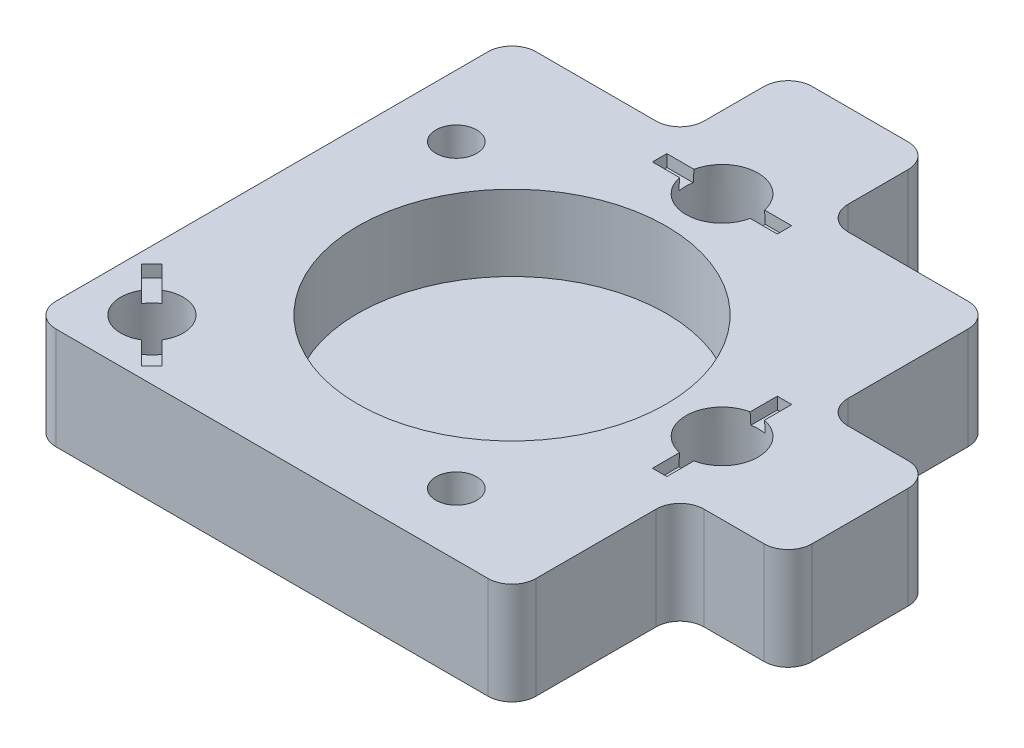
ISO-10303-21;
HEADER;
FILE_DESCRIPTION(('STEP AP214'),'2;1');
FILE_NAME('part.step','',(''),(''),'','','');
FILE_SCHEMA(('AUTOMOTIVE_DESIGN { 1 0 10303 214 1 1 1 1 }'));
ENDSEC;
DATA;
#1=APPLICATION_CONTEXT('core data for automotive mechanical design processes');
#2=APPLICATION_PROTOCOL_DEFINITION('international standard','automotive_design',2000,#1);
#3=PRODUCT_CONTEXT('',#1,'mechanical');
#4=PRODUCT('Part','Part','',(#3));
#5=PRODUCT_RELATED_PRODUCT_CATEGORY('part','',(#4));
#6=PRODUCT_DEFINITION_FORMATION('','',#4);
#7=PRODUCT_DEFINITION_CONTEXT('part definition',#1,'design');
#8=PRODUCT_DEFINITION('design','',#6,#7);
#9=PRODUCT_DEFINITION_SHAPE('','',#8);
#10=(LENGTH_UNIT() NAMED_UNIT(*) SI_UNIT(.MILLI.,.METRE.));
#11=(NAMED_UNIT(*) PLANE_ANGLE_UNIT() SI_UNIT($,.RADIAN.));
#12=(NAMED_UNIT(*) SI_UNIT($,.STERADIAN.) SOLID_ANGLE_UNIT());
#13=UNCERTAINTY_MEASURE_WITH_UNIT(LENGTH_MEASURE(1.E-05),#10,'distance_accuracy_value','');
#14=(GEOMETRIC_REPRESENTATION_CONTEXT(3) GLOBAL_UNCERTAINTY_ASSIGNED_CONTEXT((#13)) GLOBAL_UNIT_ASSIGNED_CONTEXT((#10,
#11,#12)) REPRESENTATION_CONTEXT('',''));
#15=CARTESIAN_POINT('',(0.,0.,0.));
#16=DIRECTION('',(0.,0.,1.));
#17=DIRECTION('',(1.,0.,0.));
#18=AXIS2_PLACEMENT_3D('',#15,#16,#17);
#19=CARTESIAN_POINT('',(-14.8341334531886,8.5,-10.1955129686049));
#20=DIRECTION('',(0.,-1.,0.));
#21=DIRECTION('',(0.,0.,-1.));
#22=AXIS2_PLACEMENT_3D('',#19,#20,#21);
#23=CYLINDRICAL_SURFACE('',#22,1.7);
#24=CARTESIAN_POINT('',(-14.8341334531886,8.5,-10.1955129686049));
#25=DIRECTION('',(0.,1.,0.));
#26=DIRECTION('',(0.,0.,1.));
#27=AXIS2_PLACEMENT_3D('',#24,#25,#26);
#28=CIRCLE('',#27,1.7);
#29=CARTESIAN_POINT('',(-14.8341334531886,8.5,-8.49551296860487));
#30=VERTEX_POINT('',#29);
#31=EDGE_CURVE('E733',#30,#30,#28,.T.);
#32=ORIENTED_EDGE('',*,*,#31,.T.);
#33=EDGE_LOOP('',(#32));
#34=FACE_BOUND('',#33,.T.);
#35=CARTESIAN_POINT('',(-14.8341334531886,4.1,-10.1955129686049));
#36=DIRECTION('',(0.,-1.,0.));
#37=DIRECTION('',(0.,0.,-1.));
#38=AXIS2_PLACEMENT_3D('',#35,#36,#37);
#39=CIRCLE('',#38,1.7);
#40=CARTESIAN_POINT('',(-14.8341334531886,4.1,-11.8955129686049));
#41=VERTEX_POINT('',#40);
#42=EDGE_CURVE('E696',#41,#41,#39,.T.);
#43=ORIENTED_EDGE('',*,*,#42,.T.);
#44=EDGE_LOOP('',(#43));
#45=FACE_BOUND('',#44,.T.);
#46=ADVANCED_FACE('F47',(#34,#45),#23,.F.);
#47=CARTESIAN_POINT('',(10.1955129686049,8.5,14.8341334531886));
#48=DIRECTION('',(0.,-1.,0.));
#49=DIRECTION('',(0.,0.,-1.));
#50=AXIS2_PLACEMENT_3D('',#47,#48,#49);
#51=CYLINDRICAL_SURFACE('',#50,1.7);
#52=CARTESIAN_POINT('',(10.1955129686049,8.5,14.8341334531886));
#53=DIRECTION('',(0.,1.,0.));
#54=DIRECTION('',(0.,0.,-1.));
#55=AXIS2_PLACEMENT_3D('',#52,#53,#54);
#56=CIRCLE('',#55,1.7);
#57=CARTESIAN_POINT('',(10.1955129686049,8.5,13.1341334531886));
#58=VERTEX_POINT('',#57);
#59=EDGE_CURVE('E728',#58,#58,#56,.T.);
#60=ORIENTED_EDGE('',*,*,#59,.T.);
#61=EDGE_LOOP('',(#60));
#62=FACE_BOUND('',#61,.T.);
#63=CARTESIAN_POINT('',(10.1955129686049,4.1,14.8341334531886));
#64=DIRECTION('',(0.,-1.,0.));
#65=DIRECTION('',(0.,0.,-1.));
#66=AXIS2_PLACEMENT_3D('',#63,#64,#65);
#67=CIRCLE('',#66,1.7);
#68=CARTESIAN_POINT('',(10.1955129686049,4.1,13.1341334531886));
#69=VERTEX_POINT('',#68);
#70=EDGE_CURVE('E553',#69,#69,#67,.T.);
#71=ORIENTED_EDGE('',*,*,#70,.T.);
#72=EDGE_LOOP('',(#71));
#73=FACE_BOUND('',#72,.T.);
#74=ADVANCED_FACE('F1188',(#62,#73),#51,.F.);
#75=CARTESIAN_POINT('',(0.,8.5,0.));
#76=DIRECTION('',(0.,1.,0.));
#77=DIRECTION('',(0.,0.,1.));
#78=AXIS2_PLACEMENT_3D('',#75,#76,#77);
#79=PLANE('',#78);
#80=DIRECTION('',(0.,0.,1.));
#81=VECTOR('',#80,1.);
#82=CARTESIAN_POINT('',(16.9,8.5,5.2));
#83=LINE('',#82,#81);
#84=CARTESIAN_POINT('',(16.9,8.5,-5.2));
#85=VERTEX_POINT('',#84);
#86=CARTESIAN_POINT('',(16.9,8.5,-2.93938769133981));
#87=VERTEX_POINT('',#86);
#88=EDGE_CURVE('E624',#85,#87,#83,.T.);
#89=ORIENTED_EDGE('',*,*,#88,.F.);
#90=DIRECTION('',(-1.,0.,0.));
#91=VECTOR('',#90,1.);
#92=CARTESIAN_POINT('',(16.9,8.5,-5.2));
#93=LINE('',#92,#91);
#94=CARTESIAN_POINT('',(18.1,8.5,-5.2));
#95=VERTEX_POINT('',#94);
#96=EDGE_CURVE('E634',#95,#85,#93,.T.);
#97=ORIENTED_EDGE('',*,*,#96,.F.);
#98=DIRECTION('',(0.,0.,-1.));
#99=VECTOR('',#98,1.);
#100=CARTESIAN_POINT('',(18.1,8.5,-5.2));
#101=LINE('',#100,#99);
#102=CARTESIAN_POINT('',(18.1,8.5,-2.93938769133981));
#103=VERTEX_POINT('',#102);
#104=EDGE_CURVE('E630',#103,#95,#101,.T.);
#105=ORIENTED_EDGE('',*,*,#104,.F.);
#106=CARTESIAN_POINT('',(17.5,8.5,0.));
#107=DIRECTION('',(0.,1.,0.));
#108=DIRECTION('',(0.,0.,1.));
#109=AXIS2_PLACEMENT_3D('',#106,#107,#108);
#110=CIRCLE('',#109,2.99999999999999);
#111=CARTESIAN_POINT('',(18.1,8.5,2.93938769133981));
#112=VERTEX_POINT('',#111);
#113=EDGE_CURVE('E744',#112,#103,#110,.T.);
#114=ORIENTED_EDGE('',*,*,#113,.F.);
#115=CARTESIAN_POINT('',(18.1,8.5,5.2));
#116=VERTEX_POINT('',#115);
#117=EDGE_CURVE('E631',#116,#112,#101,.T.);
#118=ORIENTED_EDGE('',*,*,#117,.F.);
#119=DIRECTION('',(1.,0.,0.));
#120=VECTOR('',#119,1.);
#121=CARTESIAN_POINT('',(18.1,8.5,5.2));
#122=LINE('',#121,#120);
#123=CARTESIAN_POINT('',(16.9,8.5,5.2));
#124=VERTEX_POINT('',#123);
#125=EDGE_CURVE('E626',#124,#116,#122,.T.);
#126=ORIENTED_EDGE('',*,*,#125,.F.);
#127=CARTESIAN_POINT('',(16.9,8.5,2.93938769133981));
#128=VERTEX_POINT('',#127);
#129=EDGE_CURVE('E627',#128,#124,#83,.T.);
#130=ORIENTED_EDGE('',*,*,#129,.F.);
#131=EDGE_CURVE('E748',#87,#128,#110,.T.);
#132=ORIENTED_EDGE('',*,*,#131,.F.);
#133=EDGE_LOOP('',(#89,#97,#105,#114,#118,#126,#130,#132));
#134=FACE_BOUND('',#133,.T.);
#135=DIRECTION('',(-1.,0.,0.));
#136=VECTOR('',#135,1.);
#137=CARTESIAN_POINT('',(-5.2,8.5,-18.1));
#138=LINE('',#137,#136);
#139=CARTESIAN_POINT('',(-2.93938769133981,8.5,-18.1));
#140=VERTEX_POINT('',#139);
#141=CARTESIAN_POINT('',(-5.2,8.5,-18.1));
#142=VERTEX_POINT('',#141);
#143=EDGE_CURVE('E662',#140,#142,#138,.T.);
#144=ORIENTED_EDGE('',*,*,#143,.F.);
#145=CARTESIAN_POINT('',(0.,8.5,-17.5));
#146=DIRECTION('',(0.,1.,0.));
#147=DIRECTION('',(0.,0.,1.));
#148=AXIS2_PLACEMENT_3D('',#145,#146,#147);
#149=CIRCLE('',#148,3.);
#150=CARTESIAN_POINT('',(2.93938769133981,8.5,-18.1));
#151=VERTEX_POINT('',#150);
#152=EDGE_CURVE('E743',#151,#140,#149,.T.);
#153=ORIENTED_EDGE('',*,*,#152,.F.);
#154=CARTESIAN_POINT('',(5.2,8.5,-18.1));
#155=VERTEX_POINT('',#154);
#156=EDGE_CURVE('E659',#155,#151,#138,.T.);
#157=ORIENTED_EDGE('',*,*,#156,.F.);
#158=DIRECTION('',(0.,0.,-1.));
#159=VECTOR('',#158,1.);
#160=CARTESIAN_POINT('',(5.2,8.5,-18.1));
#161=LINE('',#160,#159);
#162=CARTESIAN_POINT('',(5.2,8.5,-16.9));
#163=VERTEX_POINT('',#162);
#164=EDGE_CURVE('E661',#163,#155,#161,.T.);
#165=ORIENTED_EDGE('',*,*,#164,.F.);
#166=DIRECTION('',(1.,0.,0.));
#167=VECTOR('',#166,1.);
#168=CARTESIAN_POINT('',(5.2,8.5,-16.9));
#169=LINE('',#168,#167);
#170=CARTESIAN_POINT('',(2.93938769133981,8.5,-16.9));
#171=VERTEX_POINT('',#170);
#172=EDGE_CURVE('E665',#171,#163,#169,.T.);
#173=ORIENTED_EDGE('',*,*,#172,.F.);
#174=CARTESIAN_POINT('',(-2.93938769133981,8.5,-16.9));
#175=VERTEX_POINT('',#174);
#176=EDGE_CURVE('E740',#175,#171,#149,.T.);
#177=ORIENTED_EDGE('',*,*,#176,.F.);
#178=CARTESIAN_POINT('',(-5.2,8.5,-16.9));
#179=VERTEX_POINT('',#178);
#180=EDGE_CURVE('E666',#179,#175,#169,.T.);
#181=ORIENTED_EDGE('',*,*,#180,.F.);
#182=DIRECTION('',(0.,0.,1.));
#183=VECTOR('',#182,1.);
#184=CARTESIAN_POINT('',(-5.2,8.5,-16.9));
#185=LINE('',#184,#183);
#186=EDGE_CURVE('E669',#142,#179,#185,.T.);
#187=ORIENTED_EDGE('',*,*,#186,.F.);
#188=EDGE_LOOP('',(#144,#153,#157,#165,#173,#177,#181,#187));
#189=FACE_BOUND('',#188,.T.);
#190=DIRECTION('',(-0.707106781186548,0.,-0.707106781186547));
#191=VECTOR('',#190,1.);
#192=CARTESIAN_POINT('',(-18.2526911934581,8.5,10.898780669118));
#193=LINE('',#192,#191);
#194=CARTESIAN_POINT('',(-16.3645903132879,8.5,12.7868815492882));
#195=VERTEX_POINT('',#194);
#196=CARTESIAN_POINT('',(-18.2526911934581,8.5,10.898780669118));
#197=VERTEX_POINT('',#196);
#198=EDGE_CURVE('E700',#195,#197,#193,.T.);
#199=ORIENTED_EDGE('',*,*,#198,.F.);
#200=CARTESIAN_POINT('',(-15.,8.5,15.));
#201=DIRECTION('',(0.,1.,0.));
#202=DIRECTION('',(0.,0.,1.));
#203=AXIS2_PLACEMENT_3D('',#200,#201,#202);
#204=CIRCLE('',#203,2.6);
#205=CARTESIAN_POINT('',(-12.7868815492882,8.5,16.3645903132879));
#206=VERTEX_POINT('',#205);
#207=EDGE_CURVE('E739',#206,#195,#204,.T.);
#208=ORIENTED_EDGE('',*,*,#207,.F.);
#209=CARTESIAN_POINT('',(-10.898780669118,8.5,18.2526911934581));
#210=VERTEX_POINT('',#209);
#211=EDGE_CURVE('E697',#210,#206,#193,.T.);
#212=ORIENTED_EDGE('',*,*,#211,.F.);
#213=DIRECTION('',(0.707106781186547,0.,-0.707106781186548));
#214=VECTOR('',#213,1.);
#215=CARTESIAN_POINT('',(-10.898780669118,8.5,18.2526911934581));
#216=LINE('',#215,#214);
#217=CARTESIAN_POINT('',(-11.7473088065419,8.5,19.101219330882));
#218=VERTEX_POINT('',#217);
#219=EDGE_CURVE('E699',#218,#210,#216,.T.);
#220=ORIENTED_EDGE('',*,*,#219,.F.);
#221=DIRECTION('',(0.707106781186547,0.,0.707106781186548));
#222=VECTOR('',#221,1.);
#223=CARTESIAN_POINT('',(-11.7473088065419,8.5,19.101219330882));
#224=LINE('',#223,#222);
#225=CARTESIAN_POINT('',(-13.6354096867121,8.5,17.2131184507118));
#226=VERTEX_POINT('',#225);
#227=EDGE_CURVE('E703',#226,#218,#224,.T.);
#228=ORIENTED_EDGE('',*,*,#227,.F.);
#229=CARTESIAN_POINT('',(-17.2131184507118,8.5,13.6354096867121));
#230=VERTEX_POINT('',#229);
#231=EDGE_CURVE('E736',#230,#226,#204,.T.);
#232=ORIENTED_EDGE('',*,*,#231,.F.);
#233=CARTESIAN_POINT('',(-19.101219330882,8.5,11.7473088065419));
#234=VERTEX_POINT('',#233);
#235=EDGE_CURVE('E704',#234,#230,#224,.T.);
#236=ORIENTED_EDGE('',*,*,#235,.F.);
#237=DIRECTION('',(-0.707106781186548,0.,0.707106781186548));
#238=VECTOR('',#237,1.);
#239=CARTESIAN_POINT('',(-19.101219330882,8.5,11.7473088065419));
#240=LINE('',#239,#238);
#241=EDGE_CURVE('E658',#197,#234,#240,.T.);
#242=ORIENTED_EDGE('',*,*,#241,.F.);
#243=EDGE_LOOP('',(#199,#208,#212,#220,#228,#232,#236,#242));
#244=FACE_BOUND('',#243,.T.);
#245=CARTESIAN_POINT('',(0.,8.5,0.));
#246=DIRECTION('',(0.,1.,0.));
#247=DIRECTION('',(0.,0.,1.));
#248=AXIS2_PLACEMENT_3D('',#245,#246,#247);
#249=CIRCLE('',#248,12.85);
#250=CARTESIAN_POINT('',(0.,8.5,12.85));
#251=VERTEX_POINT('',#250);
#252=EDGE_CURVE('E724',#251,#251,#249,.T.);
#253=ORIENTED_EDGE('',*,*,#252,.F.);
#254=EDGE_LOOP('',(#253));
#255=FACE_BOUND('',#254,.T.);
#256=ORIENTED_EDGE('',*,*,#31,.F.);
#257=EDGE_LOOP('',(#256));
#258=FACE_BOUND('',#257,.T.);
#259=DIRECTION('',(0.,0.,1.));
#260=VECTOR('',#259,1.);
#261=CARTESIAN_POINT('',(-20.,8.5,-20.));
#262=LINE('',#261,#260);
#263=CARTESIAN_POINT('',(-20.,8.5,-18.));
#264=VERTEX_POINT('',#263);
#265=CARTESIAN_POINT('',(-20.,8.5,18.));
#266=VERTEX_POINT('',#265);
#267=EDGE_CURVE('E749',#264,#266,#262,.T.);
#268=ORIENTED_EDGE('',*,*,#267,.T.);
#269=CARTESIAN_POINT('',(-18.,8.5,18.));
#270=DIRECTION('',(0.,1.,0.));
#271=DIRECTION('',(0.,0.,1.));
#272=AXIS2_PLACEMENT_3D('',#269,#270,#271);
#273=CIRCLE('',#272,2.);
#274=CARTESIAN_POINT('',(-18.,8.5,20.));
#275=VERTEX_POINT('',#274);
#276=EDGE_CURVE('E860',#266,#275,#273,.T.);
#277=ORIENTED_EDGE('',*,*,#276,.T.);
#278=DIRECTION('',(1.,0.,0.));
#279=VECTOR('',#278,1.);
#280=CARTESIAN_POINT('',(-20.,8.5,20.));
#281=LINE('',#280,#279);
#282=CARTESIAN_POINT('',(18.,8.5,20.));
#283=VERTEX_POINT('',#282);
#284=EDGE_CURVE('E752',#275,#283,#281,.T.);
#285=ORIENTED_EDGE('',*,*,#284,.T.);
#286=CARTESIAN_POINT('',(18.,8.5,18.));
#287=DIRECTION('',(0.,1.,0.));
#288=DIRECTION('',(0.,0.,1.));
#289=AXIS2_PLACEMENT_3D('',#286,#287,#288);
#290=CIRCLE('',#289,2.);
#291=CARTESIAN_POINT('',(20.,8.5,18.));
#292=VERTEX_POINT('',#291);
#293=EDGE_CURVE('E858',#283,#292,#290,.T.);
#294=ORIENTED_EDGE('',*,*,#293,.T.);
#295=DIRECTION('',(0.,0.,-1.));
#296=VECTOR('',#295,1.);
#297=CARTESIAN_POINT('',(20.,8.5,20.));
#298=LINE('',#297,#296);
#299=CARTESIAN_POINT('',(20.,8.5,8.));
#300=VERTEX_POINT('',#299);
#301=EDGE_CURVE('E756',#292,#300,#298,.T.);
#302=ORIENTED_EDGE('',*,*,#301,.T.);
#303=CARTESIAN_POINT('',(22.,8.5,8.));
#304=DIRECTION('',(0.,1.,0.));
#305=DIRECTION('',(0.,0.,1.));
#306=AXIS2_PLACEMENT_3D('',#303,#304,#305);
#307=CIRCLE('',#306,2.);
#308=CARTESIAN_POINT('',(22.,8.5,6.));
#309=VERTEX_POINT('',#308);
#310=EDGE_CURVE('E926',#300,#309,#307,.F.);
#311=ORIENTED_EDGE('',*,*,#310,.T.);
#312=DIRECTION('',(1.,0.,0.));
#313=VECTOR('',#312,1.);
#314=CARTESIAN_POINT('',(20.,8.5,6.));
#315=LINE('',#314,#313);
#316=CARTESIAN_POINT('',(27.,8.5,6.));
#317=VERTEX_POINT('',#316);
#318=EDGE_CURVE('E759',#309,#317,#315,.T.);
#319=ORIENTED_EDGE('',*,*,#318,.T.);
#320=CARTESIAN_POINT('',(27.,8.5,4.));
#321=DIRECTION('',(0.,1.,0.));
#322=DIRECTION('',(0.,0.,1.));
#323=AXIS2_PLACEMENT_3D('',#320,#321,#322);
#324=CIRCLE('',#323,2.);
#325=CARTESIAN_POINT('',(29.,8.5,4.));
#326=VERTEX_POINT('',#325);
#327=EDGE_CURVE('E846',#317,#326,#324,.T.);
#328=ORIENTED_EDGE('',*,*,#327,.T.);
#329=DIRECTION('',(0.,0.,-1.));
#330=VECTOR('',#329,1.);
#331=CARTESIAN_POINT('',(29.,8.5,6.));
#332=LINE('',#331,#330);
#333=CARTESIAN_POINT('',(29.,8.5,-4.));
#334=VERTEX_POINT('',#333);
#335=EDGE_CURVE('E762',#326,#334,#332,.T.);
#336=ORIENTED_EDGE('',*,*,#335,.T.);
#337=CARTESIAN_POINT('',(27.,8.5,-4.));
#338=DIRECTION('',(0.,1.,0.));
#339=DIRECTION('',(0.,0.,1.));
#340=AXIS2_PLACEMENT_3D('',#337,#338,#339);
#341=CIRCLE('',#340,2.);
#342=CARTESIAN_POINT('',(27.,8.5,-6.));
#343=VERTEX_POINT('',#342);
#344=EDGE_CURVE('E848',#334,#343,#341,.T.);
#345=ORIENTED_EDGE('',*,*,#344,.T.);
#346=DIRECTION('',(-1.,0.,0.));
#347=VECTOR('',#346,1.);
#348=CARTESIAN_POINT('',(29.,8.5,-6.));
#349=LINE('',#348,#347);
#350=CARTESIAN_POINT('',(22.,8.5,-6.));
#351=VERTEX_POINT('',#350);
#352=EDGE_CURVE('E765',#343,#351,#349,.T.);
#353=ORIENTED_EDGE('',*,*,#352,.T.);
#354=CARTESIAN_POINT('',(22.,8.5,-8.));
#355=DIRECTION('',(0.,1.,0.));
#356=DIRECTION('',(0.,0.,1.));
#357=AXIS2_PLACEMENT_3D('',#354,#355,#356);
#358=CIRCLE('',#357,2.);
#359=CARTESIAN_POINT('',(20.,8.5,-8.));
#360=VERTEX_POINT('',#359);
#361=EDGE_CURVE('E922',#351,#360,#358,.F.);
#362=ORIENTED_EDGE('',*,*,#361,.T.);
#363=DIRECTION('',(0.,0.,-1.));
#364=VECTOR('',#363,1.);
#365=CARTESIAN_POINT('',(20.,8.5,-6.));
#366=LINE('',#365,#364);
#367=CARTESIAN_POINT('',(20.,8.5,-18.));
#368=VERTEX_POINT('',#367);
#369=EDGE_CURVE('E768',#360,#368,#366,.T.);
#370=ORIENTED_EDGE('',*,*,#369,.T.);
#371=CARTESIAN_POINT('',(18.,8.5,-18.));
#372=DIRECTION('',(0.,1.,0.));
#373=DIRECTION('',(0.,0.,1.));
#374=AXIS2_PLACEMENT_3D('',#371,#372,#373);
#375=CIRCLE('',#374,2.);
#376=CARTESIAN_POINT('',(18.,8.5,-20.));
#377=VERTEX_POINT('',#376);
#378=EDGE_CURVE('E850',#368,#377,#375,.T.);
#379=ORIENTED_EDGE('',*,*,#378,.T.);
#380=DIRECTION('',(-1.,0.,0.));
#381=VECTOR('',#380,1.);
#382=CARTESIAN_POINT('',(20.,8.5,-20.));
#383=LINE('',#382,#381);
#384=CARTESIAN_POINT('',(8.,8.5,-20.));
#385=VERTEX_POINT('',#384);
#386=EDGE_CURVE('E771',#377,#385,#383,.T.);
#387=ORIENTED_EDGE('',*,*,#386,.T.);
#388=CARTESIAN_POINT('',(8.,8.5,-22.));
#389=DIRECTION('',(0.,1.,0.));
#390=DIRECTION('',(0.,0.,1.));
#391=AXIS2_PLACEMENT_3D('',#388,#389,#390);
#392=CIRCLE('',#391,2.);
#393=CARTESIAN_POINT('',(6.,8.5,-22.));
#394=VERTEX_POINT('',#393);
#395=EDGE_CURVE('E918',#385,#394,#392,.F.);
#396=ORIENTED_EDGE('',*,*,#395,.T.);
#397=DIRECTION('',(0.,0.,-1.));
#398=VECTOR('',#397,1.);
#399=CARTESIAN_POINT('',(6.,8.5,-20.));
#400=LINE('',#399,#398);
#401=CARTESIAN_POINT('',(6.,8.5,-27.));
#402=VERTEX_POINT('',#401);
#403=EDGE_CURVE('E774',#394,#402,#400,.T.);
#404=ORIENTED_EDGE('',*,*,#403,.T.);
#405=CARTESIAN_POINT('',(4.,8.5,-27.));
#406=DIRECTION('',(0.,1.,0.));
#407=DIRECTION('',(0.,0.,1.));
#408=AXIS2_PLACEMENT_3D('',#405,#406,#407);
#409=CIRCLE('',#408,2.);
#410=CARTESIAN_POINT('',(4.,8.5,-29.));
#411=VERTEX_POINT('',#410);
#412=EDGE_CURVE('E852',#402,#411,#409,.T.);
#413=ORIENTED_EDGE('',*,*,#412,.T.);
#414=DIRECTION('',(-1.,0.,0.));
#415=VECTOR('',#414,1.);
#416=CARTESIAN_POINT('',(6.,8.5,-29.));
#417=LINE('',#416,#415);
#418=CARTESIAN_POINT('',(-4.,8.5,-29.));
#419=VERTEX_POINT('',#418);
#420=EDGE_CURVE('E777',#411,#419,#417,.T.);
#421=ORIENTED_EDGE('',*,*,#420,.T.);
#422=CARTESIAN_POINT('',(-4.,8.5,-27.));
#423=DIRECTION('',(0.,1.,0.));
#424=DIRECTION('',(0.,0.,1.));
#425=AXIS2_PLACEMENT_3D('',#422,#423,#424);
#426=CIRCLE('',#425,2.);
#427=CARTESIAN_POINT('',(-6.,8.5,-27.));
#428=VERTEX_POINT('',#427);
#429=EDGE_CURVE('E854',#419,#428,#426,.T.);
#430=ORIENTED_EDGE('',*,*,#429,.T.);
#431=DIRECTION('',(0.,0.,1.));
#432=VECTOR('',#431,1.);
#433=CARTESIAN_POINT('',(-6.,8.5,-29.));
#434=LINE('',#433,#432);
#435=CARTESIAN_POINT('',(-6.,8.5,-22.));
#436=VERTEX_POINT('',#435);
#437=EDGE_CURVE('E780',#428,#436,#434,.T.);
#438=ORIENTED_EDGE('',*,*,#437,.T.);
#439=CARTESIAN_POINT('',(-8.,8.5,-22.));
#440=DIRECTION('',(0.,1.,0.));
#441=DIRECTION('',(0.,0.,1.));
#442=AXIS2_PLACEMENT_3D('',#439,#440,#441);
#443=CIRCLE('',#442,2.);
#444=CARTESIAN_POINT('',(-8.,8.5,-20.));
#445=VERTEX_POINT('',#444);
#446=EDGE_CURVE('E914',#436,#445,#443,.F.);
#447=ORIENTED_EDGE('',*,*,#446,.T.);
#448=DIRECTION('',(-1.,0.,0.));
#449=VECTOR('',#448,1.);
#450=CARTESIAN_POINT('',(-6.,8.5,-20.));
#451=LINE('',#450,#449);
#452=CARTESIAN_POINT('',(-18.,8.5,-20.));
#453=VERTEX_POINT('',#452);
#454=EDGE_CURVE('E783',#445,#453,#451,.T.);
#455=ORIENTED_EDGE('',*,*,#454,.T.);
#456=CARTESIAN_POINT('',(-18.,8.5,-18.));
#457=DIRECTION('',(0.,1.,0.));
#458=DIRECTION('',(0.,0.,1.));
#459=AXIS2_PLACEMENT_3D('',#456,#457,#458);
#460=CIRCLE('',#459,2.);
#461=EDGE_CURVE('E856',#453,#264,#460,.T.);
#462=ORIENTED_EDGE('',*,*,#461,.T.);
#463=EDGE_LOOP('',(#268,#277,#285,#294,#302,#311,#319,#328,#336,#345,#353,#362,#370,#379,#387,
#396,#404,#413,#421,#430,#438,#447,#455,#462));
#464=FACE_BOUND('',#463,.T.);
#465=ORIENTED_EDGE('',*,*,#59,.F.);
#466=EDGE_LOOP('',(#465));
#467=FACE_BOUND('',#466,.T.);
#468=ADVANCED_FACE('F1195',(#134,#189,#244,#255,#258,#464,#467),#79,.T.);
#469=CARTESIAN_POINT('',(0.,0.,0.));
#470=DIRECTION('',(0.,1.,0.));
#471=DIRECTION('',(0.,0.,1.));
#472=AXIS2_PLACEMENT_3D('',#469,#470,#471);
#473=PLANE('',#472);
#474=DIRECTION('',(1.,0.,0.));
#475=VECTOR('',#474,1.);
#476=CARTESIAN_POINT('',(0.6,0.,-28.5));
#477=LINE('',#476,#475);
#478=CARTESIAN_POINT('',(-0.8,0.,-28.5));
#479=VERTEX_POINT('',#478);
#480=CARTESIAN_POINT('',(0.8,0.,-28.5));
#481=VERTEX_POINT('',#480);
#482=EDGE_CURVE('E1133',#479,#481,#477,.T.);
#483=ORIENTED_EDGE('',*,*,#482,.F.);
#484=DIRECTION('',(0.,0.,-1.));
#485=VECTOR('',#484,1.);
#486=CARTESIAN_POINT('',(-0.799999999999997,0.,0.));
#487=LINE('',#486,#485);
#488=CARTESIAN_POINT('',(-0.799999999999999,0.,-21.5));
#489=VERTEX_POINT('',#488);
#490=EDGE_CURVE('E1059',#479,#489,#487,.F.);
#491=ORIENTED_EDGE('',*,*,#490,.T.);
#492=DIRECTION('',(-1.,0.,0.));
#493=VECTOR('',#492,1.);
#494=CARTESIAN_POINT('',(-0.599999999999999,0.,-21.5));
#495=LINE('',#494,#493);
#496=CARTESIAN_POINT('',(0.799999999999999,0.,-21.5));
#497=VERTEX_POINT('',#496);
#498=EDGE_CURVE('E1135',#497,#489,#495,.T.);
#499=ORIENTED_EDGE('',*,*,#498,.F.);
#500=DIRECTION('',(0.,0.,1.));
#501=VECTOR('',#500,1.);
#502=CARTESIAN_POINT('',(0.799999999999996,0.,0.));
#503=LINE('',#502,#501);
#504=EDGE_CURVE('E1056',#497,#481,#503,.F.);
#505=ORIENTED_EDGE('',*,*,#504,.T.);
#506=EDGE_LOOP('',(#483,#491,#499,#505));
#507=FACE_BOUND('',#506,.T.);
#508=DIRECTION('',(0.,0.,1.));
#509=VECTOR('',#508,1.);
#510=CARTESIAN_POINT('',(28.5,0.,0.6));
#511=LINE('',#510,#509);
#512=CARTESIAN_POINT('',(28.5,0.,-0.8));
#513=VERTEX_POINT('',#512);
#514=CARTESIAN_POINT('',(28.5,0.,0.8));
#515=VERTEX_POINT('',#514);
#516=EDGE_CURVE('E1129',#513,#515,#511,.T.);
#517=ORIENTED_EDGE('',*,*,#516,.F.);
#518=DIRECTION('',(1.,0.,0.));
#519=VECTOR('',#518,1.);
#520=CARTESIAN_POINT('',(0.,0.,-0.800000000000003));
#521=LINE('',#520,#519);
#522=CARTESIAN_POINT('',(21.5,0.,-0.800000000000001));
#523=VERTEX_POINT('',#522);
#524=EDGE_CURVE('E1053',#513,#523,#521,.F.);
#525=ORIENTED_EDGE('',*,*,#524,.T.);
#526=DIRECTION('',(0.,0.,-1.));
#527=VECTOR('',#526,1.);
#528=CARTESIAN_POINT('',(21.5,0.,-0.600000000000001));
#529=LINE('',#528,#527);
#530=CARTESIAN_POINT('',(21.5,0.,0.800000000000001));
#531=VERTEX_POINT('',#530);
#532=EDGE_CURVE('E1131',#531,#523,#529,.T.);
#533=ORIENTED_EDGE('',*,*,#532,.F.);
#534=DIRECTION('',(-1.,0.,0.));
#535=VECTOR('',#534,1.);
#536=CARTESIAN_POINT('',(0.,0.,0.800000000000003));
#537=LINE('',#536,#535);
#538=EDGE_CURVE('E1048',#531,#515,#537,.F.);
#539=ORIENTED_EDGE('',*,*,#538,.T.);
#540=EDGE_LOOP('',(#517,#525,#533,#539));
#541=FACE_BOUND('',#540,.T.);
#542=CARTESIAN_POINT('',(-15.,0.,15.));
#543=DIRECTION('',(0.,1.,0.));
#544=DIRECTION('',(0.,0.,1.));
#545=AXIS2_PLACEMENT_3D('',#542,#543,#544);
#546=CIRCLE('',#545,3.1);
#547=CARTESIAN_POINT('',(-15.,0.,18.1));
#548=VERTEX_POINT('',#547);
#549=EDGE_CURVE('E938',#548,#548,#546,.T.);
#550=ORIENTED_EDGE('',*,*,#549,.T.);
#551=EDGE_LOOP('',(#550));
#552=FACE_BOUND('',#551,.T.);
#553=CARTESIAN_POINT('',(17.5,0.,0.));
#554=DIRECTION('',(0.,1.,0.));
#555=DIRECTION('',(0.,0.,1.));
#556=AXIS2_PLACEMENT_3D('',#553,#554,#555);
#557=CIRCLE('',#556,3.50000000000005);
#558=CARTESIAN_POINT('',(17.5,0.,3.50000000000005));
#559=VERTEX_POINT('',#558);
#560=EDGE_CURVE('E935',#559,#559,#557,.T.);
#561=ORIENTED_EDGE('',*,*,#560,.T.);
#562=EDGE_LOOP('',(#561));
#563=FACE_BOUND('',#562,.T.);
#564=CARTESIAN_POINT('',(0.,0.,-17.5));
#565=DIRECTION('',(0.,1.,0.));
#566=DIRECTION('',(0.,0.,1.));
#567=AXIS2_PLACEMENT_3D('',#564,#565,#566);
#568=CIRCLE('',#567,3.49999999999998);
#569=CARTESIAN_POINT('',(0.,0.,-14.));
#570=VERTEX_POINT('',#569);
#571=EDGE_CURVE('E928',#570,#570,#568,.T.);
#572=ORIENTED_EDGE('',*,*,#571,.T.);
#573=EDGE_LOOP('',(#572));
#574=FACE_BOUND('',#573,.T.);
#575=DIRECTION('',(-0.866025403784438,0.,0.5));
#576=VECTOR('',#575,1.);
#577=CARTESIAN_POINT('',(-11.8341334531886,0.,-8.46346216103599));
#578=LINE('',#577,#576);
#579=CARTESIAN_POINT('',(-11.8341334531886,0.,-8.46346216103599));
#580=VERTEX_POINT('',#579);
#581=CARTESIAN_POINT('',(-14.8341334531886,0.,-6.73141135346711));
#582=VERTEX_POINT('',#581);
#583=EDGE_CURVE('E540',#580,#582,#578,.T.);
#584=ORIENTED_EDGE('',*,*,#583,.F.);
#585=DIRECTION('',(0.,0.,1.));
#586=VECTOR('',#585,1.);
#587=CARTESIAN_POINT('',(-11.8341334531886,0.,-11.9275637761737));
#588=LINE('',#587,#586);
#589=CARTESIAN_POINT('',(-11.8341334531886,0.,-11.9275637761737));
#590=VERTEX_POINT('',#589);
#591=EDGE_CURVE('E505',#590,#580,#588,.T.);
#592=ORIENTED_EDGE('',*,*,#591,.F.);
#593=DIRECTION('',(0.866025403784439,0.,0.5));
#594=VECTOR('',#593,1.);
#595=CARTESIAN_POINT('',(-14.8341334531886,0.,-13.6596145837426));
#596=LINE('',#595,#594);
#597=CARTESIAN_POINT('',(-14.8341334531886,0.,-13.6596145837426));
#598=VERTEX_POINT('',#597);
#599=EDGE_CURVE('E523',#598,#590,#596,.T.);
#600=ORIENTED_EDGE('',*,*,#599,.F.);
#601=DIRECTION('',(0.866025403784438,0.,-0.500000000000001));
#602=VECTOR('',#601,1.);
#603=CARTESIAN_POINT('',(-17.8341334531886,0.,-11.9275637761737));
#604=LINE('',#603,#602);
#605=CARTESIAN_POINT('',(-17.8341334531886,0.,-11.9275637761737));
#606=VERTEX_POINT('',#605);
#607=EDGE_CURVE('E526',#606,#598,#604,.T.);
#608=ORIENTED_EDGE('',*,*,#607,.F.);
#609=DIRECTION('',(0.,0.,-1.));
#610=VECTOR('',#609,1.);
#611=CARTESIAN_POINT('',(-17.8341334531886,0.,-8.46346216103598));
#612=LINE('',#611,#610);
#613=CARTESIAN_POINT('',(-17.8341334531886,0.,-8.46346216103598));
#614=VERTEX_POINT('',#613);
#615=EDGE_CURVE('E546',#614,#606,#612,.T.);
#616=ORIENTED_EDGE('',*,*,#615,.F.);
#617=DIRECTION('',(-0.866025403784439,0.,-0.5));
#618=VECTOR('',#617,1.);
#619=CARTESIAN_POINT('',(-14.8341334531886,0.,-6.73141135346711));
#620=LINE('',#619,#618);
#621=EDGE_CURVE('E543',#582,#614,#620,.T.);
#622=ORIENTED_EDGE('',*,*,#621,.F.);
#623=EDGE_LOOP('',(#584,#592,#600,#608,#616,#622));
#624=FACE_BOUND('',#623,.T.);
#625=DIRECTION('',(-0.5,0.,-0.866025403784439));
#626=VECTOR('',#625,1.);
#627=CARTESIAN_POINT('',(8.46346216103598,0.,17.8341334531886));
#628=LINE('',#627,#626);
#629=CARTESIAN_POINT('',(8.46346216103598,0.,17.8341334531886));
#630=VERTEX_POINT('',#629);
#631=CARTESIAN_POINT('',(6.7314113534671,0.,14.8341334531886));
#632=VERTEX_POINT('',#631);
#633=EDGE_CURVE('E589',#630,#632,#628,.T.);
#634=ORIENTED_EDGE('',*,*,#633,.F.);
#635=DIRECTION('',(-1.,0.,0.));
#636=VECTOR('',#635,1.);
#637=CARTESIAN_POINT('',(11.9275637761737,0.,17.8341334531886));
#638=LINE('',#637,#636);
#639=CARTESIAN_POINT('',(11.9275637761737,0.,17.8341334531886));
#640=VERTEX_POINT('',#639);
#641=EDGE_CURVE('E541',#640,#630,#638,.T.);
#642=ORIENTED_EDGE('',*,*,#641,.F.);
#643=DIRECTION('',(-0.5,0.,0.866025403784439));
#644=VECTOR('',#643,1.);
#645=CARTESIAN_POINT('',(13.6596145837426,0.,14.8341334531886));
#646=LINE('',#645,#644);
#647=CARTESIAN_POINT('',(13.6596145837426,0.,14.8341334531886));
#648=VERTEX_POINT('',#647);
#649=EDGE_CURVE('E576',#648,#640,#646,.T.);
#650=ORIENTED_EDGE('',*,*,#649,.F.);
#651=DIRECTION('',(0.5,0.,0.866025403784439));
#652=VECTOR('',#651,1.);
#653=CARTESIAN_POINT('',(11.9275637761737,0.,11.8341334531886));
#654=LINE('',#653,#652);
#655=CARTESIAN_POINT('',(11.9275637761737,0.,11.8341334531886));
#656=VERTEX_POINT('',#655);
#657=EDGE_CURVE('E579',#656,#648,#654,.T.);
#658=ORIENTED_EDGE('',*,*,#657,.F.);
#659=DIRECTION('',(1.,0.,0.));
#660=VECTOR('',#659,1.);
#661=CARTESIAN_POINT('',(8.46346216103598,0.,11.8341334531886));
#662=LINE('',#661,#660);
#663=CARTESIAN_POINT('',(8.46346216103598,0.,11.8341334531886));
#664=VERTEX_POINT('',#663);
#665=EDGE_CURVE('E583',#664,#656,#662,.T.);
#666=ORIENTED_EDGE('',*,*,#665,.F.);
#667=DIRECTION('',(0.5,0.,-0.866025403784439));
#668=VECTOR('',#667,1.);
#669=CARTESIAN_POINT('',(6.7314113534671,0.,14.8341334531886));
#670=LINE('',#669,#668);
#671=EDGE_CURVE('E586',#632,#664,#670,.T.);
#672=ORIENTED_EDGE('',*,*,#671,.F.);
#673=EDGE_LOOP('',(#634,#642,#650,#658,#666,#672));
#674=FACE_BOUND('',#673,.T.);
#675=CARTESIAN_POINT('',(0.,0.,0.));
#676=DIRECTION('',(0.,-1.,0.));
#677=DIRECTION('',(0.,0.,-1.));
#678=AXIS2_PLACEMENT_3D('',#675,#676,#677);
#679=CIRCLE('',#678,2.24499443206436);
#680=CARTESIAN_POINT('',(0.,0.,-2.24499443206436));
#681=VERTEX_POINT('',#680);
#682=EDGE_CURVE('E639',#681,#681,#679,.T.);
#683=ORIENTED_EDGE('',*,*,#682,.F.);
#684=EDGE_LOOP('',(#683));
#685=FACE_BOUND('',#684,.T.);
#686=DIRECTION('',(1.,0.,0.));
#687=VECTOR('',#686,1.);
#688=CARTESIAN_POINT('',(-20.,0.,20.));
#689=LINE('',#688,#687);
#690=CARTESIAN_POINT('',(-18.,0.,20.));
#691=VERTEX_POINT('',#690);
#692=CARTESIAN_POINT('',(18.,0.,20.));
#693=VERTEX_POINT('',#692);
#694=EDGE_CURVE('E789',#691,#693,#689,.T.);
#695=ORIENTED_EDGE('',*,*,#694,.F.);
#696=CARTESIAN_POINT('',(-18.,0.,18.));
#697=DIRECTION('',(0.,1.,0.));
#698=DIRECTION('',(0.,0.,1.));
#699=AXIS2_PLACEMENT_3D('',#696,#697,#698);
#700=CIRCLE('',#699,2.);
#701=CARTESIAN_POINT('',(-20.,0.,18.));
#702=VERTEX_POINT('',#701);
#703=EDGE_CURVE('E839',#691,#702,#700,.F.);
#704=ORIENTED_EDGE('',*,*,#703,.T.);
#705=DIRECTION('',(0.,0.,1.));
#706=VECTOR('',#705,1.);
#707=CARTESIAN_POINT('',(-20.,0.,-20.));
#708=LINE('',#707,#706);
#709=CARTESIAN_POINT('',(-20.,0.,-18.));
#710=VERTEX_POINT('',#709);
#711=EDGE_CURVE('E747',#710,#702,#708,.T.);
#712=ORIENTED_EDGE('',*,*,#711,.F.);
#713=CARTESIAN_POINT('',(-18.,0.,-18.));
#714=DIRECTION('',(0.,1.,0.));
#715=DIRECTION('',(0.,0.,1.));
#716=AXIS2_PLACEMENT_3D('',#713,#714,#715);
#717=CIRCLE('',#716,2.);
#718=CARTESIAN_POINT('',(-18.,0.,-20.));
#719=VERTEX_POINT('',#718);
#720=EDGE_CURVE('E835',#710,#719,#717,.F.);
#721=ORIENTED_EDGE('',*,*,#720,.T.);
#722=DIRECTION('',(-1.,0.,0.));
#723=VECTOR('',#722,1.);
#724=CARTESIAN_POINT('',(-6.,0.,-20.));
#725=LINE('',#724,#723);
#726=CARTESIAN_POINT('',(-8.,0.,-20.));
#727=VERTEX_POINT('',#726);
#728=EDGE_CURVE('E753',#727,#719,#725,.T.);
#729=ORIENTED_EDGE('',*,*,#728,.F.);
#730=CARTESIAN_POINT('',(-8.,0.,-22.));
#731=DIRECTION('',(0.,1.,0.));
#732=DIRECTION('',(0.,0.,1.));
#733=AXIS2_PLACEMENT_3D('',#730,#731,#732);
#734=CIRCLE('',#733,2.);
#735=CARTESIAN_POINT('',(-6.,0.,-22.));
#736=VERTEX_POINT('',#735);
#737=EDGE_CURVE('E912',#727,#736,#734,.T.);
#738=ORIENTED_EDGE('',*,*,#737,.T.);
#739=DIRECTION('',(0.,0.,1.));
#740=VECTOR('',#739,1.);
#741=CARTESIAN_POINT('',(-6.,0.,-29.));
#742=LINE('',#741,#740);
#743=CARTESIAN_POINT('',(-6.,0.,-27.));
#744=VERTEX_POINT('',#743);
#745=EDGE_CURVE('E816',#744,#736,#742,.T.);
#746=ORIENTED_EDGE('',*,*,#745,.F.);
#747=CARTESIAN_POINT('',(-4.,0.,-27.));
#748=DIRECTION('',(0.,1.,0.));
#749=DIRECTION('',(0.,0.,1.));
#750=AXIS2_PLACEMENT_3D('',#747,#748,#749);
#751=CIRCLE('',#750,2.);
#752=CARTESIAN_POINT('',(-4.,0.,-29.));
#753=VERTEX_POINT('',#752);
#754=EDGE_CURVE('E833',#744,#753,#751,.F.);
#755=ORIENTED_EDGE('',*,*,#754,.T.);
#756=DIRECTION('',(-1.,0.,0.));
#757=VECTOR('',#756,1.);
#758=CARTESIAN_POINT('',(6.,0.,-29.));
#759=LINE('',#758,#757);
#760=CARTESIAN_POINT('',(4.,0.,-29.));
#761=VERTEX_POINT('',#760);
#762=EDGE_CURVE('E813',#761,#753,#759,.T.);
#763=ORIENTED_EDGE('',*,*,#762,.F.);
#764=CARTESIAN_POINT('',(4.,0.,-27.));
#765=DIRECTION('',(0.,1.,0.));
#766=DIRECTION('',(0.,0.,1.));
#767=AXIS2_PLACEMENT_3D('',#764,#765,#766);
#768=CIRCLE('',#767,2.);
#769=CARTESIAN_POINT('',(6.,0.,-27.));
#770=VERTEX_POINT('',#769);
#771=EDGE_CURVE('E831',#761,#770,#768,.F.);
#772=ORIENTED_EDGE('',*,*,#771,.T.);
#773=DIRECTION('',(0.,0.,-1.));
#774=VECTOR('',#773,1.);
#775=CARTESIAN_POINT('',(6.,0.,-20.));
#776=LINE('',#775,#774);
#777=CARTESIAN_POINT('',(6.,0.,-22.));
#778=VERTEX_POINT('',#777);
#779=EDGE_CURVE('E810',#778,#770,#776,.T.);
#780=ORIENTED_EDGE('',*,*,#779,.F.);
#781=CARTESIAN_POINT('',(8.,0.,-22.));
#782=DIRECTION('',(0.,1.,0.));
#783=DIRECTION('',(0.,0.,1.));
#784=AXIS2_PLACEMENT_3D('',#781,#782,#783);
#785=CIRCLE('',#784,2.);
#786=CARTESIAN_POINT('',(8.,0.,-20.));
#787=VERTEX_POINT('',#786);
#788=EDGE_CURVE('E916',#778,#787,#785,.T.);
#789=ORIENTED_EDGE('',*,*,#788,.T.);
#790=DIRECTION('',(-1.,0.,0.));
#791=VECTOR('',#790,1.);
#792=CARTESIAN_POINT('',(20.,0.,-20.));
#793=LINE('',#792,#791);
#794=CARTESIAN_POINT('',(18.,0.,-20.));
#795=VERTEX_POINT('',#794);
#796=EDGE_CURVE('E807',#795,#787,#793,.T.);
#797=ORIENTED_EDGE('',*,*,#796,.F.);
#798=CARTESIAN_POINT('',(18.,0.,-18.));
#799=DIRECTION('',(0.,1.,0.));
#800=DIRECTION('',(0.,0.,1.));
#801=AXIS2_PLACEMENT_3D('',#798,#799,#800);
#802=CIRCLE('',#801,2.);
#803=CARTESIAN_POINT('',(20.,0.,-18.));
#804=VERTEX_POINT('',#803);
#805=EDGE_CURVE('E829',#795,#804,#802,.F.);
#806=ORIENTED_EDGE('',*,*,#805,.T.);
#807=DIRECTION('',(0.,0.,-1.));
#808=VECTOR('',#807,1.);
#809=CARTESIAN_POINT('',(20.,0.,-6.));
#810=LINE('',#809,#808);
#811=CARTESIAN_POINT('',(20.,0.,-8.));
#812=VERTEX_POINT('',#811);
#813=EDGE_CURVE('E804',#812,#804,#810,.T.);
#814=ORIENTED_EDGE('',*,*,#813,.F.);
#815=CARTESIAN_POINT('',(22.,0.,-8.));
#816=DIRECTION('',(0.,1.,0.));
#817=DIRECTION('',(0.,0.,1.));
#818=AXIS2_PLACEMENT_3D('',#815,#816,#817);
#819=CIRCLE('',#818,2.);
#820=CARTESIAN_POINT('',(22.,0.,-6.));
#821=VERTEX_POINT('',#820);
#822=EDGE_CURVE('E920',#812,#821,#819,.T.);
#823=ORIENTED_EDGE('',*,*,#822,.T.);
#824=DIRECTION('',(-1.,0.,0.));
#825=VECTOR('',#824,1.);
#826=CARTESIAN_POINT('',(29.,0.,-6.));
#827=LINE('',#826,#825);
#828=CARTESIAN_POINT('',(27.,0.,-6.));
#829=VERTEX_POINT('',#828);
#830=EDGE_CURVE('E801',#829,#821,#827,.T.);
#831=ORIENTED_EDGE('',*,*,#830,.F.);
#832=CARTESIAN_POINT('',(27.,0.,-4.));
#833=DIRECTION('',(0.,1.,0.));
#834=DIRECTION('',(0.,0.,1.));
#835=AXIS2_PLACEMENT_3D('',#832,#833,#834);
#836=CIRCLE('',#835,2.);
#837=CARTESIAN_POINT('',(29.,0.,-4.));
#838=VERTEX_POINT('',#837);
#839=EDGE_CURVE('E827',#829,#838,#836,.F.);
#840=ORIENTED_EDGE('',*,*,#839,.T.);
#841=DIRECTION('',(0.,0.,-1.));
#842=VECTOR('',#841,1.);
#843=CARTESIAN_POINT('',(29.,0.,6.));
#844=LINE('',#843,#842);
#845=CARTESIAN_POINT('',(29.,0.,4.));
#846=VERTEX_POINT('',#845);
#847=EDGE_CURVE('E798',#846,#838,#844,.T.);
#848=ORIENTED_EDGE('',*,*,#847,.F.);
#849=CARTESIAN_POINT('',(27.,0.,4.));
#850=DIRECTION('',(0.,1.,0.));
#851=DIRECTION('',(0.,0.,1.));
#852=AXIS2_PLACEMENT_3D('',#849,#850,#851);
#853=CIRCLE('',#852,2.);
#854=CARTESIAN_POINT('',(27.,0.,6.));
#855=VERTEX_POINT('',#854);
#856=EDGE_CURVE('E825',#846,#855,#853,.F.);
#857=ORIENTED_EDGE('',*,*,#856,.T.);
#858=DIRECTION('',(1.,0.,0.));
#859=VECTOR('',#858,1.);
#860=CARTESIAN_POINT('',(20.,0.,6.));
#861=LINE('',#860,#859);
#862=CARTESIAN_POINT('',(22.,0.,6.));
#863=VERTEX_POINT('',#862);
#864=EDGE_CURVE('E795',#863,#855,#861,.T.);
#865=ORIENTED_EDGE('',*,*,#864,.F.);
#866=CARTESIAN_POINT('',(22.,0.,8.));
#867=DIRECTION('',(0.,1.,0.));
#868=DIRECTION('',(0.,0.,1.));
#869=AXIS2_PLACEMENT_3D('',#866,#867,#868);
#870=CIRCLE('',#869,2.);
#871=CARTESIAN_POINT('',(20.,0.,8.));
#872=VERTEX_POINT('',#871);
#873=EDGE_CURVE('E924',#863,#872,#870,.T.);
#874=ORIENTED_EDGE('',*,*,#873,.T.);
#875=DIRECTION('',(0.,0.,-1.));
#876=VECTOR('',#875,1.);
#877=CARTESIAN_POINT('',(20.,0.,20.));
#878=LINE('',#877,#876);
#879=CARTESIAN_POINT('',(20.,0.,18.));
#880=VERTEX_POINT('',#879);
#881=EDGE_CURVE('E792',#880,#872,#878,.T.);
#882=ORIENTED_EDGE('',*,*,#881,.F.);
#883=CARTESIAN_POINT('',(18.,0.,18.));
#884=DIRECTION('',(0.,1.,0.));
#885=DIRECTION('',(0.,0.,1.));
#886=AXIS2_PLACEMENT_3D('',#883,#884,#885);
#887=CIRCLE('',#886,2.);
#888=EDGE_CURVE('E837',#880,#693,#887,.F.);
#889=ORIENTED_EDGE('',*,*,#888,.T.);
#890=EDGE_LOOP('',(#695,#704,#712,#721,#729,#738,#746,#755,#763,#772,#780,#789,#797,#806,#814,
#823,#831,#840,#848,#857,#865,#874,#882,#889));
#891=FACE_BOUND('',#890,.T.);
#892=ADVANCED_FACE('F1171',(#507,#541,#552,#563,#574,#624,#674,#685,#891),#473,.F.);
#893=CARTESIAN_POINT('',(-20.,8.5,-20.));
#894=DIRECTION('',(1.,0.,0.));
#895=DIRECTION('',(0.,0.,-1.));
#896=AXIS2_PLACEMENT_3D('',#893,#894,#895);
#897=PLANE('',#896);
#898=ORIENTED_EDGE('',*,*,#711,.T.);
#899=DIRECTION('',(0.,-1.,0.));
#900=VECTOR('',#899,1.);
#901=CARTESIAN_POINT('',(-20.,8.5,18.));
#902=LINE('',#901,#900);
#903=EDGE_CURVE('E844',#702,#266,#902,.F.);
#904=ORIENTED_EDGE('',*,*,#903,.T.);
#905=ORIENTED_EDGE('',*,*,#267,.F.);
#906=DIRECTION('',(0.,-1.,0.));
#907=VECTOR('',#906,1.);
#908=CARTESIAN_POINT('',(-20.,8.5,-18.));
#909=LINE('',#908,#907);
#910=EDGE_CURVE('E841',#264,#710,#909,.T.);
#911=ORIENTED_EDGE('',*,*,#910,.T.);
#912=EDGE_LOOP('',(#898,#904,#905,#911));
#913=FACE_BOUND('',#912,.T.);
#914=ADVANCED_FACE('F1206',(#913),#897,.F.);
#915=CARTESIAN_POINT('',(-20.,8.5,20.));
#916=DIRECTION('',(0.,0.,-1.));
#917=DIRECTION('',(-1.,0.,0.));
#918=AXIS2_PLACEMENT_3D('',#915,#916,#917);
#919=PLANE('',#918);
#920=ORIENTED_EDGE('',*,*,#284,.F.);
#921=DIRECTION('',(0.,-1.,0.));
#922=VECTOR('',#921,1.);
#923=CARTESIAN_POINT('',(-18.,8.5,20.));
#924=LINE('',#923,#922);
#925=EDGE_CURVE('E822',#275,#691,#924,.T.);
#926=ORIENTED_EDGE('',*,*,#925,.T.);
#927=ORIENTED_EDGE('',*,*,#694,.T.);
#928=DIRECTION('',(0.,-1.,0.));
#929=VECTOR('',#928,1.);
#930=CARTESIAN_POINT('',(18.,8.5,20.));
#931=LINE('',#930,#929);
#932=EDGE_CURVE('E786',#693,#283,#931,.F.);
#933=ORIENTED_EDGE('',*,*,#932,.T.);
#934=EDGE_LOOP('',(#920,#926,#927,#933));
#935=FACE_BOUND('',#934,.T.);
#936=ADVANCED_FACE('F1247',(#935),#919,.F.);
#937=CARTESIAN_POINT('',(20.,8.5,20.));
#938=DIRECTION('',(-1.,0.,0.));
#939=DIRECTION('',(0.,0.,1.));
#940=AXIS2_PLACEMENT_3D('',#937,#938,#939);
#941=PLANE('',#940);
#942=ORIENTED_EDGE('',*,*,#301,.F.);
#943=DIRECTION('',(0.,-1.,0.));
#944=VECTOR('',#943,1.);
#945=CARTESIAN_POINT('',(20.,8.5,18.));
#946=LINE('',#945,#944);
#947=EDGE_CURVE('E864',#292,#880,#946,.T.);
#948=ORIENTED_EDGE('',*,*,#947,.T.);
#949=ORIENTED_EDGE('',*,*,#881,.T.);
#950=DIRECTION('',(0.,-1.,0.));
#951=VECTOR('',#950,1.);
#952=CARTESIAN_POINT('',(20.,8.5,8.));
#953=LINE('',#952,#951);
#954=EDGE_CURVE('E862',#872,#300,#953,.F.);
#955=ORIENTED_EDGE('',*,*,#954,.T.);
#956=EDGE_LOOP('',(#942,#948,#949,#955));
#957=FACE_BOUND('',#956,.T.);
#958=ADVANCED_FACE('F1243',(#957),#941,.F.);
#959=CARTESIAN_POINT('',(20.,8.5,6.));
#960=DIRECTION('',(0.,0.,-1.));
#961=DIRECTION('',(-1.,0.,0.));
#962=AXIS2_PLACEMENT_3D('',#959,#960,#961);
#963=PLANE('',#962);
#964=ORIENTED_EDGE('',*,*,#864,.T.);
#965=DIRECTION('',(0.,-1.,0.));
#966=VECTOR('',#965,1.);
#967=CARTESIAN_POINT('',(27.,8.5,6.));
#968=LINE('',#967,#966);
#969=EDGE_CURVE('E910',#855,#317,#968,.F.);
#970=ORIENTED_EDGE('',*,*,#969,.T.);
#971=ORIENTED_EDGE('',*,*,#318,.F.);
#972=DIRECTION('',(0.,-1.,0.));
#973=VECTOR('',#972,1.);
#974=CARTESIAN_POINT('',(22.,0.,6.));
#975=LINE('',#974,#973);
#976=EDGE_CURVE('E907',#309,#863,#975,.T.);
#977=ORIENTED_EDGE('',*,*,#976,.T.);
#978=EDGE_LOOP('',(#964,#970,#971,#977));
#979=FACE_BOUND('',#978,.T.);
#980=ADVANCED_FACE('F1239',(#979),#963,.F.);
#981=CARTESIAN_POINT('',(29.,8.5,6.));
#982=DIRECTION('',(-1.,0.,0.));
#983=DIRECTION('',(0.,0.,1.));
#984=AXIS2_PLACEMENT_3D('',#981,#982,#983);
#985=PLANE('',#984);
#986=ORIENTED_EDGE('',*,*,#847,.T.);
#987=DIRECTION('',(0.,-1.,0.));
#988=VECTOR('',#987,1.);
#989=CARTESIAN_POINT('',(29.,8.5,-4.));
#990=LINE('',#989,#988);
#991=EDGE_CURVE('E905',#838,#334,#990,.F.);
#992=ORIENTED_EDGE('',*,*,#991,.T.);
#993=ORIENTED_EDGE('',*,*,#335,.F.);
#994=DIRECTION('',(0.,-1.,0.));
#995=VECTOR('',#994,1.);
#996=CARTESIAN_POINT('',(29.,8.5,4.));
#997=LINE('',#996,#995);
#998=EDGE_CURVE('E902',#326,#846,#997,.T.);
#999=ORIENTED_EDGE('',*,*,#998,.T.);
#1000=EDGE_LOOP('',(#986,#992,#993,#999));
#1001=FACE_BOUND('',#1000,.T.);
#1002=ADVANCED_FACE('F1235',(#1001),#985,.F.);
#1003=CARTESIAN_POINT('',(29.,8.5,-6.));
#1004=DIRECTION('',(0.,0.,1.));
#1005=DIRECTION('',(1.,0.,0.));
#1006=AXIS2_PLACEMENT_3D('',#1003,#1004,#1005);
#1007=PLANE('',#1006);
#1008=ORIENTED_EDGE('',*,*,#830,.T.);
#1009=DIRECTION('',(0.,-1.,0.));
#1010=VECTOR('',#1009,1.);
#1011=CARTESIAN_POINT('',(22.,8.5,-6.));
#1012=LINE('',#1011,#1010);
#1013=EDGE_CURVE('E900',#821,#351,#1012,.F.);
#1014=ORIENTED_EDGE('',*,*,#1013,.T.);
#1015=ORIENTED_EDGE('',*,*,#352,.F.);
#1016=DIRECTION('',(0.,-1.,0.));
#1017=VECTOR('',#1016,1.);
#1018=CARTESIAN_POINT('',(27.,8.5,-6.));
#1019=LINE('',#1018,#1017);
#1020=EDGE_CURVE('E897',#343,#829,#1019,.T.);
#1021=ORIENTED_EDGE('',*,*,#1020,.T.);
#1022=EDGE_LOOP('',(#1008,#1014,#1015,#1021));
#1023=FACE_BOUND('',#1022,.T.);
#1024=ADVANCED_FACE('F1231',(#1023),#1007,.F.);
#1025=CARTESIAN_POINT('',(20.,8.5,-6.));
#1026=DIRECTION('',(-1.,0.,0.));
#1027=DIRECTION('',(0.,0.,1.));
#1028=AXIS2_PLACEMENT_3D('',#1025,#1026,#1027);
#1029=PLANE('',#1028);
#1030=ORIENTED_EDGE('',*,*,#813,.T.);
#1031=DIRECTION('',(0.,-1.,0.));
#1032=VECTOR('',#1031,1.);
#1033=CARTESIAN_POINT('',(20.,8.5,-18.));
#1034=LINE('',#1033,#1032);
#1035=EDGE_CURVE('E895',#804,#368,#1034,.F.);
#1036=ORIENTED_EDGE('',*,*,#1035,.T.);
#1037=ORIENTED_EDGE('',*,*,#369,.F.);
#1038=DIRECTION('',(0.,-1.,0.));
#1039=VECTOR('',#1038,1.);
#1040=CARTESIAN_POINT('',(20.,0.,-8.));
#1041=LINE('',#1040,#1039);
#1042=EDGE_CURVE('E892',#360,#812,#1041,.T.);
#1043=ORIENTED_EDGE('',*,*,#1042,.T.);
#1044=EDGE_LOOP('',(#1030,#1036,#1037,#1043));
#1045=FACE_BOUND('',#1044,.T.);
#1046=ADVANCED_FACE('F1227',(#1045),#1029,.F.);
#1047=CARTESIAN_POINT('',(20.,8.5,-20.));
#1048=DIRECTION('',(0.,0.,1.));
#1049=DIRECTION('',(1.,0.,0.));
#1050=AXIS2_PLACEMENT_3D('',#1047,#1048,#1049);
#1051=PLANE('',#1050);
#1052=ORIENTED_EDGE('',*,*,#796,.T.);
#1053=DIRECTION('',(0.,-1.,0.));
#1054=VECTOR('',#1053,1.);
#1055=CARTESIAN_POINT('',(8.,8.5,-20.));
#1056=LINE('',#1055,#1054);
#1057=EDGE_CURVE('E890',#787,#385,#1056,.F.);
#1058=ORIENTED_EDGE('',*,*,#1057,.T.);
#1059=ORIENTED_EDGE('',*,*,#386,.F.);
#1060=DIRECTION('',(0.,-1.,0.));
#1061=VECTOR('',#1060,1.);
#1062=CARTESIAN_POINT('',(18.,8.5,-20.));
#1063=LINE('',#1062,#1061);
#1064=EDGE_CURVE('E887',#377,#795,#1063,.T.);
#1065=ORIENTED_EDGE('',*,*,#1064,.T.);
#1066=EDGE_LOOP('',(#1052,#1058,#1059,#1065));
#1067=FACE_BOUND('',#1066,.T.);
#1068=ADVANCED_FACE('F1223',(#1067),#1051,.F.);
#1069=CARTESIAN_POINT('',(6.,8.5,-20.));
#1070=DIRECTION('',(-1.,0.,0.));
#1071=DIRECTION('',(0.,0.,1.));
#1072=AXIS2_PLACEMENT_3D('',#1069,#1070,#1071);
#1073=PLANE('',#1072);
#1074=ORIENTED_EDGE('',*,*,#779,.T.);
#1075=DIRECTION('',(0.,-1.,0.));
#1076=VECTOR('',#1075,1.);
#1077=CARTESIAN_POINT('',(6.,8.5,-27.));
#1078=LINE('',#1077,#1076);
#1079=EDGE_CURVE('E885',#770,#402,#1078,.F.);
#1080=ORIENTED_EDGE('',*,*,#1079,.T.);
#1081=ORIENTED_EDGE('',*,*,#403,.F.);
#1082=DIRECTION('',(0.,-1.,0.));
#1083=VECTOR('',#1082,1.);
#1084=CARTESIAN_POINT('',(6.,0.,-22.));
#1085=LINE('',#1084,#1083);
#1086=EDGE_CURVE('E882',#394,#778,#1085,.T.);
#1087=ORIENTED_EDGE('',*,*,#1086,.T.);
#1088=EDGE_LOOP('',(#1074,#1080,#1081,#1087));
#1089=FACE_BOUND('',#1088,.T.);
#1090=ADVANCED_FACE('F1219',(#1089),#1073,.F.);
#1091=CARTESIAN_POINT('',(6.,8.5,-29.));
#1092=DIRECTION('',(0.,0.,1.));
#1093=DIRECTION('',(1.,0.,0.));
#1094=AXIS2_PLACEMENT_3D('',#1091,#1092,#1093);
#1095=PLANE('',#1094);
#1096=ORIENTED_EDGE('',*,*,#762,.T.);
#1097=DIRECTION('',(0.,-1.,0.));
#1098=VECTOR('',#1097,1.);
#1099=CARTESIAN_POINT('',(-4.,8.5,-29.));
#1100=LINE('',#1099,#1098);
#1101=EDGE_CURVE('E880',#753,#419,#1100,.F.);
#1102=ORIENTED_EDGE('',*,*,#1101,.T.);
#1103=ORIENTED_EDGE('',*,*,#420,.F.);
#1104=DIRECTION('',(0.,-1.,0.));
#1105=VECTOR('',#1104,1.);
#1106=CARTESIAN_POINT('',(4.,8.5,-29.));
#1107=LINE('',#1106,#1105);
#1108=EDGE_CURVE('E877',#411,#761,#1107,.T.);
#1109=ORIENTED_EDGE('',*,*,#1108,.T.);
#1110=EDGE_LOOP('',(#1096,#1102,#1103,#1109));
#1111=FACE_BOUND('',#1110,.T.);
#1112=ADVANCED_FACE('F1215',(#1111),#1095,.F.);
#1113=CARTESIAN_POINT('',(-6.,8.5,-29.));
#1114=DIRECTION('',(1.,0.,0.));
#1115=DIRECTION('',(0.,0.,-1.));
#1116=AXIS2_PLACEMENT_3D('',#1113,#1114,#1115);
#1117=PLANE('',#1116);
#1118=ORIENTED_EDGE('',*,*,#745,.T.);
#1119=DIRECTION('',(0.,-1.,0.));
#1120=VECTOR('',#1119,1.);
#1121=CARTESIAN_POINT('',(-6.,8.5,-22.));
#1122=LINE('',#1121,#1120);
#1123=EDGE_CURVE('E875',#736,#436,#1122,.F.);
#1124=ORIENTED_EDGE('',*,*,#1123,.T.);
#1125=ORIENTED_EDGE('',*,*,#437,.F.);
#1126=DIRECTION('',(0.,-1.,0.));
#1127=VECTOR('',#1126,1.);
#1128=CARTESIAN_POINT('',(-6.,8.5,-27.));
#1129=LINE('',#1128,#1127);
#1130=EDGE_CURVE('E872',#428,#744,#1129,.T.);
#1131=ORIENTED_EDGE('',*,*,#1130,.T.);
#1132=EDGE_LOOP('',(#1118,#1124,#1125,#1131));
#1133=FACE_BOUND('',#1132,.T.);
#1134=ADVANCED_FACE('F1211',(#1133),#1117,.F.);
#1135=CARTESIAN_POINT('',(-6.,8.5,-20.));
#1136=DIRECTION('',(0.,0.,1.));
#1137=DIRECTION('',(1.,0.,0.));
#1138=AXIS2_PLACEMENT_3D('',#1135,#1136,#1137);
#1139=PLANE('',#1138);
#1140=ORIENTED_EDGE('',*,*,#728,.T.);
#1141=DIRECTION('',(0.,-1.,0.));
#1142=VECTOR('',#1141,1.);
#1143=CARTESIAN_POINT('',(-18.,8.5,-20.));
#1144=LINE('',#1143,#1142);
#1145=EDGE_CURVE('E870',#719,#453,#1144,.F.);
#1146=ORIENTED_EDGE('',*,*,#1145,.T.);
#1147=ORIENTED_EDGE('',*,*,#454,.F.);
#1148=DIRECTION('',(0.,-1.,0.));
#1149=VECTOR('',#1148,1.);
#1150=CARTESIAN_POINT('',(-8.,0.,-20.));
#1151=LINE('',#1150,#1149);
#1152=EDGE_CURVE('E867',#445,#727,#1151,.T.);
#1153=ORIENTED_EDGE('',*,*,#1152,.T.);
#1154=EDGE_LOOP('',(#1140,#1146,#1147,#1153));
#1155=FACE_BOUND('',#1154,.T.);
#1156=ADVANCED_FACE('F1207',(#1155),#1139,.F.);
#1157=CARTESIAN_POINT('',(0.,2.2,0.));
#1158=DIRECTION('',(0.,1.,0.));
#1159=DIRECTION('',(0.,0.,1.));
#1160=AXIS2_PLACEMENT_3D('',#1157,#1158,#1159);
#1161=CYLINDRICAL_SURFACE('',#1160,12.85);
#1162=CARTESIAN_POINT('',(0.,2.2,0.));
#1163=DIRECTION('',(0.,1.,0.));
#1164=DIRECTION('',(0.,0.,1.));
#1165=AXIS2_PLACEMENT_3D('',#1162,#1163,#1164);
#1166=CIRCLE('',#1165,12.85);
#1167=CARTESIAN_POINT('',(0.,2.2,12.85));
#1168=VERTEX_POINT('',#1167);
#1169=EDGE_CURVE('E725',#1168,#1168,#1166,.T.);
#1170=ORIENTED_EDGE('',*,*,#1169,.F.);
#1171=EDGE_LOOP('',(#1170));
#1172=FACE_BOUND('',#1171,.T.);
#1173=ORIENTED_EDGE('',*,*,#252,.T.);
#1174=EDGE_LOOP('',(#1173));
#1175=FACE_BOUND('',#1174,.T.);
#1176=ADVANCED_FACE('F1210',(#1172,#1175),#1161,.F.);
#1177=CARTESIAN_POINT('',(0.,2.2,0.));
#1178=DIRECTION('',(0.,1.,0.));
#1179=DIRECTION('',(0.,0.,1.));
#1180=AXIS2_PLACEMENT_3D('',#1177,#1178,#1179);
#1181=PLANE('',#1180);
#1182=ORIENTED_EDGE('',*,*,#1169,.T.);
#1183=EDGE_LOOP('',(#1182));
#1184=FACE_BOUND('',#1183,.T.);
#1185=ADVANCED_FACE('F1259',(#1184),#1181,.T.);
#1186=CARTESIAN_POINT('',(-18.,8.5,18.));
#1187=DIRECTION('',(0.,-1.,0.));
#1188=DIRECTION('',(0.,0.,-1.));
#1189=AXIS2_PLACEMENT_3D('',#1186,#1187,#1188);
#1190=CYLINDRICAL_SURFACE('',#1189,2.);
#1191=ORIENTED_EDGE('',*,*,#276,.F.);
#1192=ORIENTED_EDGE('',*,*,#903,.F.);
#1193=ORIENTED_EDGE('',*,*,#703,.F.);
#1194=ORIENTED_EDGE('',*,*,#925,.F.);
#1195=EDGE_LOOP('',(#1191,#1192,#1193,#1194));
#1196=FACE_BOUND('',#1195,.T.);
#1197=ADVANCED_FACE('F1255',(#1196),#1190,.T.);
#1198=CARTESIAN_POINT('',(18.,8.5,18.));
#1199=DIRECTION('',(0.,-1.,0.));
#1200=DIRECTION('',(0.,0.,-1.));
#1201=AXIS2_PLACEMENT_3D('',#1198,#1199,#1200);
#1202=CYLINDRICAL_SURFACE('',#1201,2.);
#1203=ORIENTED_EDGE('',*,*,#293,.F.);
#1204=ORIENTED_EDGE('',*,*,#932,.F.);
#1205=ORIENTED_EDGE('',*,*,#888,.F.);
#1206=ORIENTED_EDGE('',*,*,#947,.F.);
#1207=EDGE_LOOP('',(#1203,#1204,#1205,#1206));
#1208=FACE_BOUND('',#1207,.T.);
#1209=ADVANCED_FACE('F1258',(#1208),#1202,.T.);
#1210=CARTESIAN_POINT('',(-18.,8.5,-18.));
#1211=DIRECTION('',(0.,-1.,0.));
#1212=DIRECTION('',(0.,0.,-1.));
#1213=AXIS2_PLACEMENT_3D('',#1210,#1211,#1212);
#1214=CYLINDRICAL_SURFACE('',#1213,2.);
#1215=ORIENTED_EDGE('',*,*,#461,.F.);
#1216=ORIENTED_EDGE('',*,*,#1145,.F.);
#1217=ORIENTED_EDGE('',*,*,#720,.F.);
#1218=ORIENTED_EDGE('',*,*,#910,.F.);
#1219=EDGE_LOOP('',(#1215,#1216,#1217,#1218));
#1220=FACE_BOUND('',#1219,.T.);
#1221=ADVANCED_FACE('F1263',(#1220),#1214,.T.);
#1222=CARTESIAN_POINT('',(-8.,8.5,-22.));
#1223=DIRECTION('',(0.,1.,0.));
#1224=DIRECTION('',(0.,0.,1.));
#1225=AXIS2_PLACEMENT_3D('',#1222,#1223,#1224);
#1226=CYLINDRICAL_SURFACE('',#1225,2.);
#1227=ORIENTED_EDGE('',*,*,#446,.F.);
#1228=ORIENTED_EDGE('',*,*,#1123,.F.);
#1229=ORIENTED_EDGE('',*,*,#737,.F.);
#1230=ORIENTED_EDGE('',*,*,#1152,.F.);
#1231=EDGE_LOOP('',(#1227,#1228,#1229,#1230));
#1232=FACE_BOUND('',#1231,.T.);
#1233=ADVANCED_FACE('F1267',(#1232),#1226,.F.);
#1234=CARTESIAN_POINT('',(-4.,8.5,-27.));
#1235=DIRECTION('',(0.,-1.,0.));
#1236=DIRECTION('',(0.,0.,-1.));
#1237=AXIS2_PLACEMENT_3D('',#1234,#1235,#1236);
#1238=CYLINDRICAL_SURFACE('',#1237,2.);
#1239=ORIENTED_EDGE('',*,*,#429,.F.);
#1240=ORIENTED_EDGE('',*,*,#1101,.F.);
#1241=ORIENTED_EDGE('',*,*,#754,.F.);
#1242=ORIENTED_EDGE('',*,*,#1130,.F.);
#1243=EDGE_LOOP('',(#1239,#1240,#1241,#1242));
#1244=FACE_BOUND('',#1243,.T.);
#1245=ADVANCED_FACE('F1271',(#1244),#1238,.T.);
#1246=CARTESIAN_POINT('',(4.,8.5,-27.));
#1247=DIRECTION('',(0.,-1.,0.));
#1248=DIRECTION('',(0.,0.,-1.));
#1249=AXIS2_PLACEMENT_3D('',#1246,#1247,#1248);
#1250=CYLINDRICAL_SURFACE('',#1249,2.);
#1251=ORIENTED_EDGE('',*,*,#412,.F.);
#1252=ORIENTED_EDGE('',*,*,#1079,.F.);
#1253=ORIENTED_EDGE('',*,*,#771,.F.);
#1254=ORIENTED_EDGE('',*,*,#1108,.F.);
#1255=EDGE_LOOP('',(#1251,#1252,#1253,#1254));
#1256=FACE_BOUND('',#1255,.T.);
#1257=ADVANCED_FACE('F1275',(#1256),#1250,.T.);
#1258=CARTESIAN_POINT('',(8.,8.5,-22.));
#1259=DIRECTION('',(0.,1.,0.));
#1260=DIRECTION('',(0.,0.,1.));
#1261=AXIS2_PLACEMENT_3D('',#1258,#1259,#1260);
#1262=CYLINDRICAL_SURFACE('',#1261,2.);
#1263=ORIENTED_EDGE('',*,*,#395,.F.);
#1264=ORIENTED_EDGE('',*,*,#1057,.F.);
#1265=ORIENTED_EDGE('',*,*,#788,.F.);
#1266=ORIENTED_EDGE('',*,*,#1086,.F.);
#1267=EDGE_LOOP('',(#1263,#1264,#1265,#1266));
#1268=FACE_BOUND('',#1267,.T.);
#1269=ADVANCED_FACE('F1279',(#1268),#1262,.F.);
#1270=CARTESIAN_POINT('',(18.,8.5,-18.));
#1271=DIRECTION('',(0.,-1.,0.));
#1272=DIRECTION('',(0.,0.,-1.));
#1273=AXIS2_PLACEMENT_3D('',#1270,#1271,#1272);
#1274=CYLINDRICAL_SURFACE('',#1273,2.);
#1275=ORIENTED_EDGE('',*,*,#378,.F.);
#1276=ORIENTED_EDGE('',*,*,#1035,.F.);
#1277=ORIENTED_EDGE('',*,*,#805,.F.);
#1278=ORIENTED_EDGE('',*,*,#1064,.F.);
#1279=EDGE_LOOP('',(#1275,#1276,#1277,#1278));
#1280=FACE_BOUND('',#1279,.T.);
#1281=ADVANCED_FACE('F1283',(#1280),#1274,.T.);
#1282=CARTESIAN_POINT('',(22.,8.5,-8.));
#1283=DIRECTION('',(0.,1.,0.));
#1284=DIRECTION('',(0.,0.,1.));
#1285=AXIS2_PLACEMENT_3D('',#1282,#1283,#1284);
#1286=CYLINDRICAL_SURFACE('',#1285,2.);
#1287=ORIENTED_EDGE('',*,*,#361,.F.);
#1288=ORIENTED_EDGE('',*,*,#1013,.F.);
#1289=ORIENTED_EDGE('',*,*,#822,.F.);
#1290=ORIENTED_EDGE('',*,*,#1042,.F.);
#1291=EDGE_LOOP('',(#1287,#1288,#1289,#1290));
#1292=FACE_BOUND('',#1291,.T.);
#1293=ADVANCED_FACE('F1287',(#1292),#1286,.F.);
#1294=CARTESIAN_POINT('',(27.,8.5,-4.));
#1295=DIRECTION('',(0.,-1.,0.));
#1296=DIRECTION('',(0.,0.,-1.));
#1297=AXIS2_PLACEMENT_3D('',#1294,#1295,#1296);
#1298=CYLINDRICAL_SURFACE('',#1297,2.);
#1299=ORIENTED_EDGE('',*,*,#344,.F.);
#1300=ORIENTED_EDGE('',*,*,#991,.F.);
#1301=ORIENTED_EDGE('',*,*,#839,.F.);
#1302=ORIENTED_EDGE('',*,*,#1020,.F.);
#1303=EDGE_LOOP('',(#1299,#1300,#1301,#1302));
#1304=FACE_BOUND('',#1303,.T.);
#1305=ADVANCED_FACE('F1291',(#1304),#1298,.T.);
#1306=CARTESIAN_POINT('',(27.,8.5,4.));
#1307=DIRECTION('',(0.,-1.,0.));
#1308=DIRECTION('',(0.,0.,-1.));
#1309=AXIS2_PLACEMENT_3D('',#1306,#1307,#1308);
#1310=CYLINDRICAL_SURFACE('',#1309,2.);
#1311=ORIENTED_EDGE('',*,*,#327,.F.);
#1312=ORIENTED_EDGE('',*,*,#969,.F.);
#1313=ORIENTED_EDGE('',*,*,#856,.F.);
#1314=ORIENTED_EDGE('',*,*,#998,.F.);
#1315=EDGE_LOOP('',(#1311,#1312,#1313,#1314));
#1316=FACE_BOUND('',#1315,.T.);
#1317=ADVANCED_FACE('F1295',(#1316),#1310,.T.);
#1318=CARTESIAN_POINT('',(22.,8.5,8.));
#1319=DIRECTION('',(0.,1.,0.));
#1320=DIRECTION('',(0.,0.,1.));
#1321=AXIS2_PLACEMENT_3D('',#1318,#1319,#1320);
#1322=CYLINDRICAL_SURFACE('',#1321,2.);
#1323=ORIENTED_EDGE('',*,*,#310,.F.);
#1324=ORIENTED_EDGE('',*,*,#954,.F.);
#1325=ORIENTED_EDGE('',*,*,#873,.F.);
#1326=ORIENTED_EDGE('',*,*,#976,.F.);
#1327=EDGE_LOOP('',(#1323,#1324,#1325,#1326));
#1328=FACE_BOUND('',#1327,.T.);
#1329=ADVANCED_FACE('F1298',(#1328),#1322,.F.);
#1330=CARTESIAN_POINT('',(0.,-1.5,0.));
#1331=DIRECTION('',(0.,-1.,0.));
#1332=DIRECTION('',(1.,0.,0.));
#1333=AXIS2_PLACEMENT_3D('',#1330,#1331,#1332);
#1334=SPHERICAL_SURFACE('',#1333,2.7);
#1335=ORIENTED_EDGE('',*,*,#682,.T.);
#1336=EDGE_LOOP('',(#1335));
#1337=FACE_BOUND('',#1336,.T.);
#1338=ADVANCED_FACE('F1301',(#1337),#1334,.F.);
#1339=CARTESIAN_POINT('',(0.,7.5,0.));
#1340=DIRECTION('',(0.,-1.,0.));
#1341=DIRECTION('',(0.,0.,-1.));
#1342=AXIS2_PLACEMENT_3D('',#1339,#1340,#1341);
#1343=PLANE('',#1342);
#1344=DIRECTION('',(0.707106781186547,0.,0.707106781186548));
#1345=VECTOR('',#1344,1.);
#1346=CARTESIAN_POINT('',(-11.7473088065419,7.5,19.101219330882));
#1347=LINE('',#1346,#1345);
#1348=CARTESIAN_POINT('',(-19.101219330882,7.5,11.7473088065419));
#1349=VERTEX_POINT('',#1348);
#1350=CARTESIAN_POINT('',(-17.2558402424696,7.5,13.5926878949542));
#1351=VERTEX_POINT('',#1350);
#1352=EDGE_CURVE('E716',#1349,#1351,#1347,.T.);
#1353=ORIENTED_EDGE('',*,*,#1352,.T.);
#1354=CARTESIAN_POINT('',(-15.,7.5,15.));
#1355=DIRECTION('',(0.,-1.,0.));
#1356=DIRECTION('',(0.,0.,-1.));
#1357=AXIS2_PLACEMENT_3D('',#1354,#1355,#1356);
#1358=CIRCLE('',#1357,2.65882352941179);
#1359=CARTESIAN_POINT('',(-16.4073121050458,7.5,12.7441597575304));
#1360=VERTEX_POINT('',#1359);
#1361=EDGE_CURVE('E949',#1351,#1360,#1358,.T.);
#1362=ORIENTED_EDGE('',*,*,#1361,.T.);
#1363=DIRECTION('',(-0.707106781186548,0.,-0.707106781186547));
#1364=VECTOR('',#1363,1.);
#1365=CARTESIAN_POINT('',(-18.2526911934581,7.5,10.898780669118));
#1366=LINE('',#1365,#1364);
#1367=CARTESIAN_POINT('',(-18.2526911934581,7.5,10.898780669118));
#1368=VERTEX_POINT('',#1367);
#1369=EDGE_CURVE('E687',#1360,#1368,#1366,.T.);
#1370=ORIENTED_EDGE('',*,*,#1369,.T.);
#1371=DIRECTION('',(-0.707106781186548,0.,0.707106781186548));
#1372=VECTOR('',#1371,1.);
#1373=CARTESIAN_POINT('',(-19.101219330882,7.5,11.7473088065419));
#1374=LINE('',#1373,#1372);
#1375=EDGE_CURVE('E719',#1368,#1349,#1374,.T.);
#1376=ORIENTED_EDGE('',*,*,#1375,.T.);
#1377=EDGE_LOOP('',(#1353,#1362,#1370,#1376));
#1378=FACE_BOUND('',#1377,.T.);
#1379=ADVANCED_FACE('F1306',(#1378),#1343,.F.);
#1380=CARTESIAN_POINT('',(-11.7473088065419,7.5,19.101219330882));
#1381=DIRECTION('',(-0.707106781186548,0.,0.707106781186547));
#1382=DIRECTION('',(0.707106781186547,0.,0.707106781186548));
#1383=AXIS2_PLACEMENT_3D('',#1380,#1381,#1382);
#1384=PLANE('',#1383);
#1385=ORIENTED_EDGE('',*,*,#235,.T.);
#1386=CARTESIAN_POINT('',(-17.2131184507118,8.50000000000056,13.6354096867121));
#1387=CARTESIAN_POINT('',(-17.2202431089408,8.33333370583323,13.6282850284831));
#1388=CARTESIAN_POINT('',(-17.2273655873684,8.16666722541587,13.6211625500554));
#1389=CARTESIAN_POINT('',(-17.2416061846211,7.83333389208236,13.6069219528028));
#1390=CARTESIAN_POINT('',(-17.248724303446,7.6666670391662,13.5998038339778));
#1391=CARTESIAN_POINT('',(-17.2558402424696,7.5,13.5926878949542));
#1392=B_SPLINE_CURVE_WITH_KNOTS('',3,(#1386,#1387,#1388,#1389,#1390,#1391),.UNSPECIFIED.,.F.,
.F.,(4,2,4),(0.,0.500911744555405,1.00182348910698),.UNSPECIFIED.);
#1393=EDGE_CURVE('E941',#230,#1351,#1392,.T.);
#1394=ORIENTED_EDGE('',*,*,#1393,.T.);
#1395=ORIENTED_EDGE('',*,*,#1352,.F.);
#1396=DIRECTION('',(0.,1.,0.));
#1397=VECTOR('',#1396,1.);
#1398=CARTESIAN_POINT('',(-19.101219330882,7.5,11.7473088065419));
#1399=LINE('',#1398,#1397);
#1400=EDGE_CURVE('E685',#1349,#234,#1399,.T.);
#1401=ORIENTED_EDGE('',*,*,#1400,.T.);
#1402=EDGE_LOOP('',(#1385,#1394,#1395,#1401));
#1403=FACE_BOUND('',#1402,.T.);
#1404=ADVANCED_FACE('F964',(#1403),#1384,.F.);
#1405=CARTESIAN_POINT('',(-18.2526911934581,7.5,10.898780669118));
#1406=DIRECTION('',(0.707106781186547,0.,-0.707106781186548));
#1407=DIRECTION('',(-0.707106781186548,0.,-0.707106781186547));
#1408=AXIS2_PLACEMENT_3D('',#1405,#1406,#1407);
#1409=PLANE('',#1408);
#1410=ORIENTED_EDGE('',*,*,#1369,.F.);
#1411=CARTESIAN_POINT('',(-16.4073121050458,7.5,12.7441597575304));
#1412=CARTESIAN_POINT('',(-16.4001961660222,7.6666670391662,12.751275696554));
#1413=CARTESIAN_POINT('',(-16.3930780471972,7.83333389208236,12.7583938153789));
#1414=CARTESIAN_POINT('',(-16.3788374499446,8.16666722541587,12.7726344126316));
#1415=CARTESIAN_POINT('',(-16.3717149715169,8.33333370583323,12.7797568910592));
#1416=CARTESIAN_POINT('',(-16.3645903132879,8.50000000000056,12.7868815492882));
#1417=B_SPLINE_CURVE_WITH_KNOTS('',3,(#1411,#1412,#1413,#1414,#1415,#1416),.UNSPECIFIED.,.F.,
.F.,(4,2,4),(0.,0.500911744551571,1.00182348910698),.UNSPECIFIED.);
#1418=EDGE_CURVE('E2130',#1360,#195,#1417,.T.);
#1419=ORIENTED_EDGE('',*,*,#1418,.T.);
#1420=ORIENTED_EDGE('',*,*,#198,.T.);
#1421=DIRECTION('',(0.,1.,0.));
#1422=VECTOR('',#1421,1.);
#1423=CARTESIAN_POINT('',(-18.2526911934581,7.5,10.898780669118));
#1424=LINE('',#1423,#1422);
#1425=EDGE_CURVE('E693',#1368,#197,#1424,.T.);
#1426=ORIENTED_EDGE('',*,*,#1425,.F.);
#1427=EDGE_LOOP('',(#1410,#1419,#1420,#1426));
#1428=FACE_BOUND('',#1427,.T.);
#1429=ADVANCED_FACE('F1944',(#1428),#1409,.F.);
#1430=CARTESIAN_POINT('',(-19.101219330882,7.5,11.7473088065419));
#1431=DIRECTION('',(-0.707106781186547,0.,-0.707106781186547));
#1432=DIRECTION('',(-0.707106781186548,0.,0.707106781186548));
#1433=AXIS2_PLACEMENT_3D('',#1430,#1431,#1432);
#1434=PLANE('',#1433);
#1435=ORIENTED_EDGE('',*,*,#241,.T.);
#1436=ORIENTED_EDGE('',*,*,#1400,.F.);
#1437=ORIENTED_EDGE('',*,*,#1375,.F.);
#1438=ORIENTED_EDGE('',*,*,#1425,.T.);
#1439=EDGE_LOOP('',(#1435,#1436,#1437,#1438));
#1440=FACE_BOUND('',#1439,.T.);
#1441=ADVANCED_FACE('F965',(#1440),#1434,.F.);
#1442=ORIENTED_EDGE('',*,*,#211,.T.);
#1443=CARTESIAN_POINT('',(-12.7868815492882,8.50000000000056,16.3645903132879));
#1444=CARTESIAN_POINT('',(-12.7797568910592,8.33333370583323,16.3717149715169));
#1445=CARTESIAN_POINT('',(-12.7726344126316,8.16666722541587,16.3788374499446));
#1446=CARTESIAN_POINT('',(-12.7583938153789,7.83333389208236,16.3930780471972));
#1447=CARTESIAN_POINT('',(-12.751275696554,7.6666670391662,16.4001961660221));
#1448=CARTESIAN_POINT('',(-12.7441597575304,7.5,16.4073121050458));
#1449=B_SPLINE_CURVE_WITH_KNOTS('',3,(#1443,#1444,#1445,#1446,#1447,#1448),.UNSPECIFIED.,.F.,
.F.,(4,2,4),(0.,0.500911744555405,1.00182348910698),.UNSPECIFIED.);
#1450=CARTESIAN_POINT('',(-12.7441597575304,7.5,16.4073121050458));
#1451=VERTEX_POINT('',#1450);
#1452=EDGE_CURVE('E2132',#206,#1451,#1449,.T.);
#1453=ORIENTED_EDGE('',*,*,#1452,.T.);
#1454=CARTESIAN_POINT('',(-10.898780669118,7.5,18.2526911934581));
#1455=VERTEX_POINT('',#1454);
#1456=EDGE_CURVE('E709',#1455,#1451,#1366,.T.);
#1457=ORIENTED_EDGE('',*,*,#1456,.F.);
#1458=DIRECTION('',(0.,1.,0.));
#1459=VECTOR('',#1458,1.);
#1460=CARTESIAN_POINT('',(-10.898780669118,7.5,18.2526911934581));
#1461=LINE('',#1460,#1459);
#1462=EDGE_CURVE('E691',#1455,#210,#1461,.T.);
#1463=ORIENTED_EDGE('',*,*,#1462,.T.);
#1464=EDGE_LOOP('',(#1442,#1453,#1457,#1463));
#1465=FACE_BOUND('',#1464,.T.);
#1466=ADVANCED_FACE('F1954',(#1465),#1409,.F.);
#1467=ORIENTED_EDGE('',*,*,#1456,.T.);
#1468=CARTESIAN_POINT('',(-15.,7.5,15.));
#1469=DIRECTION('',(0.,-1.,0.));
#1470=DIRECTION('',(0.,0.,-1.));
#1471=AXIS2_PLACEMENT_3D('',#1468,#1469,#1470);
#1472=CIRCLE('',#1471,2.65882352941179);
#1473=CARTESIAN_POINT('',(-13.5926878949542,7.5,17.2558402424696));
#1474=VERTEX_POINT('',#1473);
#1475=EDGE_CURVE('E978',#1451,#1474,#1472,.T.);
#1476=ORIENTED_EDGE('',*,*,#1475,.T.);
#1477=CARTESIAN_POINT('',(-11.7473088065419,7.5,19.101219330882));
#1478=VERTEX_POINT('',#1477);
#1479=EDGE_CURVE('E715',#1474,#1478,#1347,.T.);
#1480=ORIENTED_EDGE('',*,*,#1479,.T.);
#1481=DIRECTION('',(0.707106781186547,0.,-0.707106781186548));
#1482=VECTOR('',#1481,1.);
#1483=CARTESIAN_POINT('',(-10.898780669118,7.5,18.2526911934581));
#1484=LINE('',#1483,#1482);
#1485=EDGE_CURVE('E712',#1478,#1455,#1484,.T.);
#1486=ORIENTED_EDGE('',*,*,#1485,.T.);
#1487=EDGE_LOOP('',(#1467,#1476,#1480,#1486));
#1488=FACE_BOUND('',#1487,.T.);
#1489=ADVANCED_FACE('F1936',(#1488),#1343,.F.);
#1490=CARTESIAN_POINT('',(-10.898780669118,7.5,18.2526911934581));
#1491=DIRECTION('',(0.707106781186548,0.,0.707106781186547));
#1492=DIRECTION('',(0.707106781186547,0.,-0.707106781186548));
#1493=AXIS2_PLACEMENT_3D('',#1490,#1491,#1492);
#1494=PLANE('',#1493);
#1495=ORIENTED_EDGE('',*,*,#219,.T.);
#1496=ORIENTED_EDGE('',*,*,#1462,.F.);
#1497=ORIENTED_EDGE('',*,*,#1485,.F.);
#1498=DIRECTION('',(0.,1.,0.));
#1499=VECTOR('',#1498,1.);
#1500=CARTESIAN_POINT('',(-11.7473088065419,7.5,19.101219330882));
#1501=LINE('',#1500,#1499);
#1502=EDGE_CURVE('E688',#1478,#218,#1501,.T.);
#1503=ORIENTED_EDGE('',*,*,#1502,.T.);
#1504=EDGE_LOOP('',(#1495,#1496,#1497,#1503));
#1505=FACE_BOUND('',#1504,.T.);
#1506=ADVANCED_FACE('F962',(#1505),#1494,.F.);
#1507=ORIENTED_EDGE('',*,*,#1479,.F.);
#1508=CARTESIAN_POINT('',(-13.5926878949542,7.5,17.2558402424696));
#1509=CARTESIAN_POINT('',(-13.5998038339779,7.6666670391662,17.248724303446));
#1510=CARTESIAN_POINT('',(-13.6069219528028,7.83333389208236,17.2416061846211));
#1511=CARTESIAN_POINT('',(-13.6211625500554,8.16666722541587,17.2273655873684));
#1512=CARTESIAN_POINT('',(-13.6282850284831,8.33333370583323,17.2202431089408));
#1513=CARTESIAN_POINT('',(-13.6354096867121,8.50000000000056,17.2131184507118));
#1514=B_SPLINE_CURVE_WITH_KNOTS('',3,(#1508,#1509,#1510,#1511,#1512,#1513),.UNSPECIFIED.,.F.,
.F.,(4,2,4),(0.,0.500911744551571,1.00182348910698),.UNSPECIFIED.);
#1515=EDGE_CURVE('E970',#1474,#226,#1514,.T.);
#1516=ORIENTED_EDGE('',*,*,#1515,.T.);
#1517=ORIENTED_EDGE('',*,*,#227,.T.);
#1518=ORIENTED_EDGE('',*,*,#1502,.F.);
#1519=EDGE_LOOP('',(#1507,#1516,#1517,#1518));
#1520=FACE_BOUND('',#1519,.T.);
#1521=ADVANCED_FACE('F956',(#1520),#1384,.F.);
#1522=CARTESIAN_POINT('',(0.,7.5,0.));
#1523=DIRECTION('',(0.,-1.,0.));
#1524=DIRECTION('',(0.,0.,-1.));
#1525=AXIS2_PLACEMENT_3D('',#1522,#1523,#1524);
#1526=PLANE('',#1525);
#1527=DIRECTION('',(1.,0.,0.));
#1528=VECTOR('',#1527,1.);
#1529=CARTESIAN_POINT('',(5.2,7.5,-16.9));
#1530=LINE('',#1529,#1528);
#1531=CARTESIAN_POINT('',(-5.2,7.5,-16.9));
#1532=VERTEX_POINT('',#1531);
#1533=CARTESIAN_POINT('',(-2.99940017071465,7.5,-16.9));
#1534=VERTEX_POINT('',#1533);
#1535=EDGE_CURVE('E679',#1532,#1534,#1530,.T.);
#1536=ORIENTED_EDGE('',*,*,#1535,.T.);
#1537=CARTESIAN_POINT('',(0.,7.5,-17.5));
#1538=DIRECTION('',(0.,-1.,0.));
#1539=DIRECTION('',(0.,0.,-1.));
#1540=AXIS2_PLACEMENT_3D('',#1537,#1538,#1539);
#1541=CIRCLE('',#1540,3.05882352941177);
#1542=CARTESIAN_POINT('',(-2.99940017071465,7.5,-18.1));
#1543=VERTEX_POINT('',#1542);
#1544=EDGE_CURVE('E1023',#1534,#1543,#1541,.T.);
#1545=ORIENTED_EDGE('',*,*,#1544,.T.);
#1546=DIRECTION('',(-1.,0.,0.));
#1547=VECTOR('',#1546,1.);
#1548=CARTESIAN_POINT('',(-5.2,7.5,-18.1));
#1549=LINE('',#1548,#1547);
#1550=CARTESIAN_POINT('',(-5.2,7.5,-18.1));
#1551=VERTEX_POINT('',#1550);
#1552=EDGE_CURVE('E649',#1543,#1551,#1549,.T.);
#1553=ORIENTED_EDGE('',*,*,#1552,.T.);
#1554=DIRECTION('',(0.,0.,1.));
#1555=VECTOR('',#1554,1.);
#1556=CARTESIAN_POINT('',(-5.2,7.5,-16.9));
#1557=LINE('',#1556,#1555);
#1558=EDGE_CURVE('E682',#1551,#1532,#1557,.T.);
#1559=ORIENTED_EDGE('',*,*,#1558,.T.);
#1560=EDGE_LOOP('',(#1536,#1545,#1553,#1559));
#1561=FACE_BOUND('',#1560,.T.);
#1562=ADVANCED_FACE('F961',(#1561),#1526,.F.);
#1563=CARTESIAN_POINT('',(5.2,7.5,-16.9));
#1564=DIRECTION('',(0.,0.,1.));
#1565=DIRECTION('',(1.,0.,0.));
#1566=AXIS2_PLACEMENT_3D('',#1563,#1564,#1565);
#1567=PLANE('',#1566);
#1568=ORIENTED_EDGE('',*,*,#180,.T.);
#1569=CARTESIAN_POINT('',(-2.93938769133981,8.50000000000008,-16.9));
#1570=CARTESIAN_POINT('',(-2.94939372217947,8.33333357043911,-16.9));
#1571=CARTESIAN_POINT('',(-2.95939777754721,8.16666702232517,-16.9));
#1572=CARTESIAN_POINT('',(-2.97940193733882,7.83333368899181,-16.9));
#1573=CARTESIAN_POINT('',(-2.9894020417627,7.66666690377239,-16.9));
#1574=CARTESIAN_POINT('',(-2.99940017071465,7.5,-16.9));
#1575=B_SPLINE_CURVE_WITH_KNOTS('',3,(#1569,#1570,#1571,#1572,#1573,#1574),.UNSPECIFIED.,.F.,
.F.,(4,2,4),(0.,0.500899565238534,1.0017991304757),.UNSPECIFIED.);
#1576=EDGE_CURVE('E1014',#175,#1534,#1575,.T.);
#1577=ORIENTED_EDGE('',*,*,#1576,.T.);
#1578=ORIENTED_EDGE('',*,*,#1535,.F.);
#1579=DIRECTION('',(0.,1.,0.));
#1580=VECTOR('',#1579,1.);
#1581=CARTESIAN_POINT('',(-5.2,7.5,-16.9));
#1582=LINE('',#1581,#1580);
#1583=EDGE_CURVE('E647',#1532,#179,#1582,.T.);
#1584=ORIENTED_EDGE('',*,*,#1583,.T.);
#1585=EDGE_LOOP('',(#1568,#1577,#1578,#1584));
#1586=FACE_BOUND('',#1585,.T.);
#1587=ADVANCED_FACE('F1036',(#1586),#1567,.F.);
#1588=CARTESIAN_POINT('',(-5.2,7.5,-18.1));
#1589=DIRECTION('',(0.,0.,-1.));
#1590=DIRECTION('',(-1.,0.,0.));
#1591=AXIS2_PLACEMENT_3D('',#1588,#1589,#1590);
#1592=PLANE('',#1591);
#1593=ORIENTED_EDGE('',*,*,#1552,.F.);
#1594=CARTESIAN_POINT('',(-2.99940017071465,7.5,-18.1));
#1595=CARTESIAN_POINT('',(-2.9894020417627,7.66666690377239,-18.1));
#1596=CARTESIAN_POINT('',(-2.97940193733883,7.83333368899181,-18.1));
#1597=CARTESIAN_POINT('',(-2.95939777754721,8.16666702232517,-18.1));
#1598=CARTESIAN_POINT('',(-2.94939372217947,8.33333357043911,-18.1));
#1599=CARTESIAN_POINT('',(-2.93938769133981,8.50000000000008,-18.1));
#1600=B_SPLINE_CURVE_WITH_KNOTS('',3,(#1594,#1595,#1596,#1597,#1598,#1599),.UNSPECIFIED.,.F.,
.F.,(4,2,4),(0.,0.500899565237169,1.0017991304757),.UNSPECIFIED.);
#1601=EDGE_CURVE('E2094',#1543,#140,#1600,.T.);
#1602=ORIENTED_EDGE('',*,*,#1601,.T.);
#1603=ORIENTED_EDGE('',*,*,#143,.T.);
#1604=DIRECTION('',(0.,1.,0.));
#1605=VECTOR('',#1604,1.);
#1606=CARTESIAN_POINT('',(-5.2,7.5,-18.1));
#1607=LINE('',#1606,#1605);
#1608=EDGE_CURVE('E655',#1551,#142,#1607,.T.);
#1609=ORIENTED_EDGE('',*,*,#1608,.F.);
#1610=EDGE_LOOP('',(#1593,#1602,#1603,#1609));
#1611=FACE_BOUND('',#1610,.T.);
#1612=ADVANCED_FACE('F2008',(#1611),#1592,.F.);
#1613=CARTESIAN_POINT('',(-5.2,7.5,-16.9));
#1614=DIRECTION('',(-1.,0.,0.));
#1615=DIRECTION('',(0.,0.,1.));
#1616=AXIS2_PLACEMENT_3D('',#1613,#1614,#1615);
#1617=PLANE('',#1616);
#1618=ORIENTED_EDGE('',*,*,#186,.T.);
#1619=ORIENTED_EDGE('',*,*,#1583,.F.);
#1620=ORIENTED_EDGE('',*,*,#1558,.F.);
#1621=ORIENTED_EDGE('',*,*,#1608,.T.);
#1622=EDGE_LOOP('',(#1618,#1619,#1620,#1621));
#1623=FACE_BOUND('',#1622,.T.);
#1624=ADVANCED_FACE('F1037',(#1623),#1617,.F.);
#1625=ORIENTED_EDGE('',*,*,#156,.T.);
#1626=CARTESIAN_POINT('',(2.93938769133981,8.50000000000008,-18.1));
#1627=CARTESIAN_POINT('',(2.94939372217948,8.33333357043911,-18.1));
#1628=CARTESIAN_POINT('',(2.95939777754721,8.16666702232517,-18.1));
#1629=CARTESIAN_POINT('',(2.97940193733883,7.83333368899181,-18.1));
#1630=CARTESIAN_POINT('',(2.9894020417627,7.66666690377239,-18.1));
#1631=CARTESIAN_POINT('',(2.99940017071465,7.5,-18.1));
#1632=B_SPLINE_CURVE_WITH_KNOTS('',3,(#1626,#1627,#1628,#1629,#1630,#1631),.UNSPECIFIED.,.F.,
.F.,(4,2,4),(0.,0.500899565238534,1.0017991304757),.UNSPECIFIED.);
#1633=CARTESIAN_POINT('',(2.99940017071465,7.5,-18.1));
#1634=VERTEX_POINT('',#1633);
#1635=EDGE_CURVE('E2090',#151,#1634,#1632,.T.);
#1636=ORIENTED_EDGE('',*,*,#1635,.T.);
#1637=CARTESIAN_POINT('',(5.2,7.5,-18.1));
#1638=VERTEX_POINT('',#1637);
#1639=EDGE_CURVE('E672',#1638,#1634,#1549,.T.);
#1640=ORIENTED_EDGE('',*,*,#1639,.F.);
#1641=DIRECTION('',(0.,1.,0.));
#1642=VECTOR('',#1641,1.);
#1643=CARTESIAN_POINT('',(5.2,7.5,-18.1));
#1644=LINE('',#1643,#1642);
#1645=EDGE_CURVE('E653',#1638,#155,#1644,.T.);
#1646=ORIENTED_EDGE('',*,*,#1645,.T.);
#1647=EDGE_LOOP('',(#1625,#1636,#1640,#1646));
#1648=FACE_BOUND('',#1647,.T.);
#1649=ADVANCED_FACE('F2018',(#1648),#1592,.F.);
#1650=ORIENTED_EDGE('',*,*,#1639,.T.);
#1651=CARTESIAN_POINT('',(0.,7.5,-17.5));
#1652=DIRECTION('',(0.,-1.,0.));
#1653=DIRECTION('',(0.,0.,-1.));
#1654=AXIS2_PLACEMENT_3D('',#1651,#1652,#1653);
#1655=CIRCLE('',#1654,3.05882352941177);
#1656=CARTESIAN_POINT('',(2.99940017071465,7.5,-16.9));
#1657=VERTEX_POINT('',#1656);
#1658=EDGE_CURVE('E1049',#1634,#1657,#1655,.T.);
#1659=ORIENTED_EDGE('',*,*,#1658,.T.);
#1660=CARTESIAN_POINT('',(5.2,7.5,-16.9));
#1661=VERTEX_POINT('',#1660);
#1662=EDGE_CURVE('E678',#1657,#1661,#1530,.T.);
#1663=ORIENTED_EDGE('',*,*,#1662,.T.);
#1664=DIRECTION('',(0.,0.,-1.));
#1665=VECTOR('',#1664,1.);
#1666=CARTESIAN_POINT('',(5.2,7.5,-18.1));
#1667=LINE('',#1666,#1665);
#1668=EDGE_CURVE('E675',#1661,#1638,#1667,.T.);
#1669=ORIENTED_EDGE('',*,*,#1668,.T.);
#1670=EDGE_LOOP('',(#1650,#1659,#1663,#1669));
#1671=FACE_BOUND('',#1670,.T.);
#1672=ADVANCED_FACE('F2000',(#1671),#1526,.F.);
#1673=CARTESIAN_POINT('',(5.2,7.5,-18.1));
#1674=DIRECTION('',(1.,0.,0.));
#1675=DIRECTION('',(0.,0.,-1.));
#1676=AXIS2_PLACEMENT_3D('',#1673,#1674,#1675);
#1677=PLANE('',#1676);
#1678=ORIENTED_EDGE('',*,*,#164,.T.);
#1679=ORIENTED_EDGE('',*,*,#1645,.F.);
#1680=ORIENTED_EDGE('',*,*,#1668,.F.);
#1681=DIRECTION('',(0.,1.,0.));
#1682=VECTOR('',#1681,1.);
#1683=CARTESIAN_POINT('',(5.2,7.5,-16.9));
#1684=LINE('',#1683,#1682);
#1685=EDGE_CURVE('E650',#1661,#163,#1684,.T.);
#1686=ORIENTED_EDGE('',*,*,#1685,.T.);
#1687=EDGE_LOOP('',(#1678,#1679,#1680,#1686));
#1688=FACE_BOUND('',#1687,.T.);
#1689=ADVANCED_FACE('F1034',(#1688),#1677,.F.);
#1690=ORIENTED_EDGE('',*,*,#1662,.F.);
#1691=CARTESIAN_POINT('',(2.99940017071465,7.5,-16.9));
#1692=CARTESIAN_POINT('',(2.9894020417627,7.66666690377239,-16.9));
#1693=CARTESIAN_POINT('',(2.97940193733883,7.83333368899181,-16.9));
#1694=CARTESIAN_POINT('',(2.95939777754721,8.16666702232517,-16.9));
#1695=CARTESIAN_POINT('',(2.94939372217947,8.33333357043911,-16.9));
#1696=CARTESIAN_POINT('',(2.93938769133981,8.50000000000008,-16.9));
#1697=B_SPLINE_CURVE_WITH_KNOTS('',3,(#1691,#1692,#1693,#1694,#1695,#1696),.UNSPECIFIED.,.F.,
.F.,(4,2,4),(0.,0.500899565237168,1.0017991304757),.UNSPECIFIED.);
#1698=EDGE_CURVE('E1041',#1657,#171,#1697,.T.);
#1699=ORIENTED_EDGE('',*,*,#1698,.T.);
#1700=ORIENTED_EDGE('',*,*,#172,.T.);
#1701=ORIENTED_EDGE('',*,*,#1685,.F.);
#1702=EDGE_LOOP('',(#1690,#1699,#1700,#1701));
#1703=FACE_BOUND('',#1702,.T.);
#1704=ADVANCED_FACE('F1029',(#1703),#1567,.F.);
#1705=CARTESIAN_POINT('',(0.,7.5,0.));
#1706=DIRECTION('',(0.,-1.,0.));
#1707=DIRECTION('',(0.,0.,-1.));
#1708=AXIS2_PLACEMENT_3D('',#1705,#1706,#1707);
#1709=PLANE('',#1708);
#1710=DIRECTION('',(0.,0.,1.));
#1711=VECTOR('',#1710,1.);
#1712=CARTESIAN_POINT('',(16.9,7.5,5.2));
#1713=LINE('',#1712,#1711);
#1714=CARTESIAN_POINT('',(16.9,7.5,-5.2));
#1715=VERTEX_POINT('',#1714);
#1716=CARTESIAN_POINT('',(16.9,7.5,-2.99940017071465));
#1717=VERTEX_POINT('',#1716);
#1718=EDGE_CURVE('E609',#1715,#1717,#1713,.T.);
#1719=ORIENTED_EDGE('',*,*,#1718,.T.);
#1720=CARTESIAN_POINT('',(17.5,7.5,0.));
#1721=DIRECTION('',(0.,-1.,0.));
#1722=DIRECTION('',(0.,0.,-1.));
#1723=AXIS2_PLACEMENT_3D('',#1720,#1721,#1722);
#1724=CIRCLE('',#1723,3.05882352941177);
#1725=CARTESIAN_POINT('',(18.1,7.5,-2.99940017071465));
#1726=VERTEX_POINT('',#1725);
#1727=EDGE_CURVE('E1015',#1717,#1726,#1724,.T.);
#1728=ORIENTED_EDGE('',*,*,#1727,.T.);
#1729=DIRECTION('',(0.,0.,-1.));
#1730=VECTOR('',#1729,1.);
#1731=CARTESIAN_POINT('',(18.1,7.5,-5.2));
#1732=LINE('',#1731,#1730);
#1733=CARTESIAN_POINT('',(18.1,7.5,-5.2));
#1734=VERTEX_POINT('',#1733);
#1735=EDGE_CURVE('E616',#1726,#1734,#1732,.T.);
#1736=ORIENTED_EDGE('',*,*,#1735,.T.);
#1737=DIRECTION('',(-1.,0.,0.));
#1738=VECTOR('',#1737,1.);
#1739=CARTESIAN_POINT('',(16.9,7.5,-5.2));
#1740=LINE('',#1739,#1738);
#1741=EDGE_CURVE('E620',#1734,#1715,#1740,.T.);
#1742=ORIENTED_EDGE('',*,*,#1741,.T.);
#1743=EDGE_LOOP('',(#1719,#1728,#1736,#1742));
#1744=FACE_BOUND('',#1743,.T.);
#1745=ADVANCED_FACE('F998',(#1744),#1709,.F.);
#1746=CARTESIAN_POINT('',(18.1,7.5,-5.2));
#1747=DIRECTION('',(1.,0.,0.));
#1748=DIRECTION('',(0.,0.,-1.));
#1749=AXIS2_PLACEMENT_3D('',#1746,#1747,#1748);
#1750=PLANE('',#1749);
#1751=ORIENTED_EDGE('',*,*,#1735,.F.);
#1752=CARTESIAN_POINT('',(18.1,7.5,-2.99940017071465));
#1753=CARTESIAN_POINT('',(18.1,7.66666690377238,-2.9894020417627));
#1754=CARTESIAN_POINT('',(18.1,7.83333368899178,-2.97940193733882));
#1755=CARTESIAN_POINT('',(18.1,8.16666702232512,-2.95939777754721));
#1756=CARTESIAN_POINT('',(18.1,8.33333357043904,-2.94939372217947));
#1757=CARTESIAN_POINT('',(18.1,8.5,-2.93938769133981));
#1758=B_SPLINE_CURVE_WITH_KNOTS('',3,(#1752,#1753,#1754,#1755,#1756,#1757),.UNSPECIFIED.,.F.,
.F.,(4,2,4),(0.,0.500899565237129,1.00179913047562),.UNSPECIFIED.);
#1759=EDGE_CURVE('E1007',#1726,#103,#1758,.T.);
#1760=ORIENTED_EDGE('',*,*,#1759,.T.);
#1761=ORIENTED_EDGE('',*,*,#104,.T.);
#1762=DIRECTION('',(0.,1.,0.));
#1763=VECTOR('',#1762,1.);
#1764=CARTESIAN_POINT('',(18.1,7.5,-5.2));
#1765=LINE('',#1764,#1763);
#1766=EDGE_CURVE('E640',#1734,#95,#1765,.T.);
#1767=ORIENTED_EDGE('',*,*,#1766,.F.);
#1768=EDGE_LOOP('',(#1751,#1760,#1761,#1767));
#1769=FACE_BOUND('',#1768,.T.);
#1770=ADVANCED_FACE('F992',(#1769),#1750,.F.);
#1771=CARTESIAN_POINT('',(16.9,7.5,5.2));
#1772=DIRECTION('',(-1.,0.,0.));
#1773=DIRECTION('',(0.,0.,1.));
#1774=AXIS2_PLACEMENT_3D('',#1771,#1772,#1773);
#1775=PLANE('',#1774);
#1776=ORIENTED_EDGE('',*,*,#88,.T.);
#1777=CARTESIAN_POINT('',(16.9,8.5,-2.93938769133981));
#1778=CARTESIAN_POINT('',(16.9,8.33333357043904,-2.94939372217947));
#1779=CARTESIAN_POINT('',(16.9,8.16666702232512,-2.95939777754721));
#1780=CARTESIAN_POINT('',(16.9,7.83333368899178,-2.97940193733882));
#1781=CARTESIAN_POINT('',(16.9,7.66666690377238,-2.9894020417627));
#1782=CARTESIAN_POINT('',(16.9,7.5,-2.99940017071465));
#1783=B_SPLINE_CURVE_WITH_KNOTS('',3,(#1777,#1778,#1779,#1780,#1781,#1782),.UNSPECIFIED.,.F.,
.F.,(4,2,4),(0.,0.500899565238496,1.00179913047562),.UNSPECIFIED.);
#1784=EDGE_CURVE('E1439',#87,#1717,#1783,.T.);
#1785=ORIENTED_EDGE('',*,*,#1784,.T.);
#1786=ORIENTED_EDGE('',*,*,#1718,.F.);
#1787=DIRECTION('',(0.,1.,0.));
#1788=VECTOR('',#1787,1.);
#1789=CARTESIAN_POINT('',(16.9,7.5,-5.2));
#1790=LINE('',#1789,#1788);
#1791=EDGE_CURVE('E637',#1715,#85,#1790,.T.);
#1792=ORIENTED_EDGE('',*,*,#1791,.T.);
#1793=EDGE_LOOP('',(#1776,#1785,#1786,#1792));
#1794=FACE_BOUND('',#1793,.T.);
#1795=ADVANCED_FACE('F997',(#1794),#1775,.F.);
#1796=CARTESIAN_POINT('',(16.9,7.5,-5.2));
#1797=DIRECTION('',(0.,0.,-1.));
#1798=DIRECTION('',(-1.,0.,0.));
#1799=AXIS2_PLACEMENT_3D('',#1796,#1797,#1798);
#1800=PLANE('',#1799);
#1801=ORIENTED_EDGE('',*,*,#96,.T.);
#1802=ORIENTED_EDGE('',*,*,#1791,.F.);
#1803=ORIENTED_EDGE('',*,*,#1741,.F.);
#1804=ORIENTED_EDGE('',*,*,#1766,.T.);
#1805=EDGE_LOOP('',(#1801,#1802,#1803,#1804));
#1806=FACE_BOUND('',#1805,.T.);
#1807=ADVANCED_FACE('F1001',(#1806),#1800,.F.);
#1808=ORIENTED_EDGE('',*,*,#117,.T.);
#1809=CARTESIAN_POINT('',(18.1,8.5,2.93938769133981));
#1810=CARTESIAN_POINT('',(18.1,8.33333357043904,2.94939372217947));
#1811=CARTESIAN_POINT('',(18.1,8.16666702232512,2.95939777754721));
#1812=CARTESIAN_POINT('',(18.1,7.83333368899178,2.97940193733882));
#1813=CARTESIAN_POINT('',(18.1,7.66666690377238,2.9894020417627));
#1814=CARTESIAN_POINT('',(18.1,7.5,2.99940017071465));
#1815=B_SPLINE_CURVE_WITH_KNOTS('',3,(#1809,#1810,#1811,#1812,#1813,#1814),.UNSPECIFIED.,.F.,
.F.,(4,2,4),(0.,0.500899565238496,1.00179913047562),.UNSPECIFIED.);
#1816=CARTESIAN_POINT('',(18.1,7.5,2.99940017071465));
#1817=VERTEX_POINT('',#1816);
#1818=EDGE_CURVE('E977',#112,#1817,#1815,.T.);
#1819=ORIENTED_EDGE('',*,*,#1818,.T.);
#1820=CARTESIAN_POINT('',(18.1,7.5,5.2));
#1821=VERTEX_POINT('',#1820);
#1822=EDGE_CURVE('E617',#1821,#1817,#1732,.T.);
#1823=ORIENTED_EDGE('',*,*,#1822,.F.);
#1824=DIRECTION('',(0.,1.,0.));
#1825=VECTOR('',#1824,1.);
#1826=CARTESIAN_POINT('',(18.1,7.5,5.2));
#1827=LINE('',#1826,#1825);
#1828=EDGE_CURVE('E643',#1821,#116,#1827,.T.);
#1829=ORIENTED_EDGE('',*,*,#1828,.T.);
#1830=EDGE_LOOP('',(#1808,#1819,#1823,#1829));
#1831=FACE_BOUND('',#1830,.T.);
#1832=ADVANCED_FACE('F1000',(#1831),#1750,.F.);
#1833=ORIENTED_EDGE('',*,*,#1822,.T.);
#1834=CARTESIAN_POINT('',(17.5,7.5,0.));
#1835=DIRECTION('',(0.,-1.,0.));
#1836=DIRECTION('',(0.,0.,-1.));
#1837=AXIS2_PLACEMENT_3D('',#1834,#1835,#1836);
#1838=CIRCLE('',#1837,3.05882352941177);
#1839=CARTESIAN_POINT('',(16.9,7.5,2.99940017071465));
#1840=VERTEX_POINT('',#1839);
#1841=EDGE_CURVE('E986',#1817,#1840,#1838,.T.);
#1842=ORIENTED_EDGE('',*,*,#1841,.T.);
#1843=CARTESIAN_POINT('',(16.9,7.5,5.2));
#1844=VERTEX_POINT('',#1843);
#1845=EDGE_CURVE('E613',#1840,#1844,#1713,.T.);
#1846=ORIENTED_EDGE('',*,*,#1845,.T.);
#1847=DIRECTION('',(1.,0.,0.));
#1848=VECTOR('',#1847,1.);
#1849=CARTESIAN_POINT('',(18.1,7.5,5.2));
#1850=LINE('',#1849,#1848);
#1851=EDGE_CURVE('E612',#1844,#1821,#1850,.T.);
#1852=ORIENTED_EDGE('',*,*,#1851,.T.);
#1853=EDGE_LOOP('',(#1833,#1842,#1846,#1852));
#1854=FACE_BOUND('',#1853,.T.);
#1855=ADVANCED_FACE('F1418',(#1854),#1709,.F.);
#1856=ORIENTED_EDGE('',*,*,#1845,.F.);
#1857=CARTESIAN_POINT('',(16.9,7.5,2.99940017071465));
#1858=CARTESIAN_POINT('',(16.9,7.66666690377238,2.9894020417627));
#1859=CARTESIAN_POINT('',(16.9,7.83333368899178,2.97940193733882));
#1860=CARTESIAN_POINT('',(16.9,8.16666702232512,2.95939777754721));
#1861=CARTESIAN_POINT('',(16.9,8.33333357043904,2.94939372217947));
#1862=CARTESIAN_POINT('',(16.9,8.5,2.93938769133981));
#1863=B_SPLINE_CURVE_WITH_KNOTS('',3,(#1857,#1858,#1859,#1860,#1861,#1862),.UNSPECIFIED.,.F.,
.F.,(4,2,4),(0.,0.500899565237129,1.00179913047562),.UNSPECIFIED.);
#1864=EDGE_CURVE('E1438',#1840,#128,#1863,.T.);
#1865=ORIENTED_EDGE('',*,*,#1864,.T.);
#1866=ORIENTED_EDGE('',*,*,#129,.T.);
#1867=DIRECTION('',(0.,1.,0.));
#1868=VECTOR('',#1867,1.);
#1869=CARTESIAN_POINT('',(16.9,7.5,5.2));
#1870=LINE('',#1869,#1868);
#1871=EDGE_CURVE('E623',#1844,#124,#1870,.T.);
#1872=ORIENTED_EDGE('',*,*,#1871,.F.);
#1873=EDGE_LOOP('',(#1856,#1865,#1866,#1872));
#1874=FACE_BOUND('',#1873,.T.);
#1875=ADVANCED_FACE('F1422',(#1874),#1775,.F.);
#1876=CARTESIAN_POINT('',(18.1,7.5,5.2));
#1877=DIRECTION('',(0.,0.,1.));
#1878=DIRECTION('',(1.,0.,0.));
#1879=AXIS2_PLACEMENT_3D('',#1876,#1877,#1878);
#1880=PLANE('',#1879);
#1881=ORIENTED_EDGE('',*,*,#125,.T.);
#1882=ORIENTED_EDGE('',*,*,#1828,.F.);
#1883=ORIENTED_EDGE('',*,*,#1851,.F.);
#1884=ORIENTED_EDGE('',*,*,#1871,.T.);
#1885=EDGE_LOOP('',(#1881,#1882,#1883,#1884));
#1886=FACE_BOUND('',#1885,.T.);
#1887=ADVANCED_FACE('F1003',(#1886),#1880,.F.);
#1888=CARTESIAN_POINT('',(11.9275637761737,4.1,17.8341334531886));
#1889=DIRECTION('',(0.,0.,1.));
#1890=DIRECTION('',(1.,0.,0.));
#1891=AXIS2_PLACEMENT_3D('',#1888,#1889,#1890);
#1892=PLANE('',#1891);
#1893=ORIENTED_EDGE('',*,*,#641,.T.);
#1894=DIRECTION('',(0.,-1.,0.));
#1895=VECTOR('',#1894,1.);
#1896=CARTESIAN_POINT('',(8.46346216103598,4.1,17.8341334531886));
#1897=LINE('',#1896,#1895);
#1898=CARTESIAN_POINT('',(8.46346216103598,4.1,17.8341334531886));
#1899=VERTEX_POINT('',#1898);
#1900=EDGE_CURVE('E561',#1899,#630,#1897,.T.);
#1901=ORIENTED_EDGE('',*,*,#1900,.F.);
#1902=DIRECTION('',(-1.,0.,0.));
#1903=VECTOR('',#1902,1.);
#1904=CARTESIAN_POINT('',(11.9275637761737,4.1,17.8341334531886));
#1905=LINE('',#1904,#1903);
#1906=CARTESIAN_POINT('',(11.9275637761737,4.1,17.8341334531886));
#1907=VERTEX_POINT('',#1906);
#1908=EDGE_CURVE('E580',#1907,#1899,#1905,.T.);
#1909=ORIENTED_EDGE('',*,*,#1908,.F.);
#1910=DIRECTION('',(0.,-1.,0.));
#1911=VECTOR('',#1910,1.);
#1912=CARTESIAN_POINT('',(11.9275637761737,4.1,17.8341334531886));
#1913=LINE('',#1912,#1911);
#1914=EDGE_CURVE('E573',#1907,#640,#1913,.T.);
#1915=ORIENTED_EDGE('',*,*,#1914,.T.);
#1916=EDGE_LOOP('',(#1893,#1901,#1909,#1915));
#1917=FACE_BOUND('',#1916,.T.);
#1918=ADVANCED_FACE('F1385',(#1917),#1892,.F.);
#1919=CARTESIAN_POINT('',(13.6596145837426,4.1,14.8341334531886));
#1920=DIRECTION('',(0.866025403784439,0.,0.5));
#1921=DIRECTION('',(0.5,0.,-0.866025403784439));
#1922=AXIS2_PLACEMENT_3D('',#1919,#1920,#1921);
#1923=PLANE('',#1922);
#1924=ORIENTED_EDGE('',*,*,#649,.T.);
#1925=ORIENTED_EDGE('',*,*,#1914,.F.);
#1926=DIRECTION('',(-0.5,0.,0.866025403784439));
#1927=VECTOR('',#1926,1.);
#1928=CARTESIAN_POINT('',(13.6596145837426,4.1,14.8341334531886));
#1929=LINE('',#1928,#1927);
#1930=CARTESIAN_POINT('',(13.6596145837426,4.1,14.8341334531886));
#1931=VERTEX_POINT('',#1930);
#1932=EDGE_CURVE('E564',#1931,#1907,#1929,.T.);
#1933=ORIENTED_EDGE('',*,*,#1932,.F.);
#1934=DIRECTION('',(0.,-1.,0.));
#1935=VECTOR('',#1934,1.);
#1936=CARTESIAN_POINT('',(13.6596145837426,4.1,14.8341334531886));
#1937=LINE('',#1936,#1935);
#1938=EDGE_CURVE('E571',#1931,#648,#1937,.T.);
#1939=ORIENTED_EDGE('',*,*,#1938,.T.);
#1940=EDGE_LOOP('',(#1924,#1925,#1933,#1939));
#1941=FACE_BOUND('',#1940,.T.);
#1942=ADVANCED_FACE('F1403',(#1941),#1923,.F.);
#1943=CARTESIAN_POINT('',(11.9275637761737,4.1,11.8341334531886));
#1944=DIRECTION('',(0.866025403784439,0.,-0.5));
#1945=DIRECTION('',(-0.5,0.,-0.866025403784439));
#1946=AXIS2_PLACEMENT_3D('',#1943,#1944,#1945);
#1947=PLANE('',#1946);
#1948=ORIENTED_EDGE('',*,*,#657,.T.);
#1949=ORIENTED_EDGE('',*,*,#1938,.F.);
#1950=DIRECTION('',(0.5,0.,0.866025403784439));
#1951=VECTOR('',#1950,1.);
#1952=CARTESIAN_POINT('',(11.9275637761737,4.1,11.8341334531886));
#1953=LINE('',#1952,#1951);
#1954=CARTESIAN_POINT('',(11.9275637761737,4.1,11.8341334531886));
#1955=VERTEX_POINT('',#1954);
#1956=EDGE_CURVE('E595',#1955,#1931,#1953,.T.);
#1957=ORIENTED_EDGE('',*,*,#1956,.F.);
#1958=DIRECTION('',(0.,-1.,0.));
#1959=VECTOR('',#1958,1.);
#1960=CARTESIAN_POINT('',(11.9275637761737,4.1,11.8341334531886));
#1961=LINE('',#1960,#1959);
#1962=EDGE_CURVE('E569',#1955,#656,#1961,.T.);
#1963=ORIENTED_EDGE('',*,*,#1962,.T.);
#1964=EDGE_LOOP('',(#1948,#1949,#1957,#1963));
#1965=FACE_BOUND('',#1964,.T.);
#1966=ADVANCED_FACE('F1400',(#1965),#1947,.F.);
#1967=CARTESIAN_POINT('',(8.46346216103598,4.1,11.8341334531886));
#1968=DIRECTION('',(0.,0.,-1.));
#1969=DIRECTION('',(-1.,0.,0.));
#1970=AXIS2_PLACEMENT_3D('',#1967,#1968,#1969);
#1971=PLANE('',#1970);
#1972=ORIENTED_EDGE('',*,*,#665,.T.);
#1973=ORIENTED_EDGE('',*,*,#1962,.F.);
#1974=DIRECTION('',(1.,0.,0.));
#1975=VECTOR('',#1974,1.);
#1976=CARTESIAN_POINT('',(8.46346216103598,4.1,11.8341334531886));
#1977=LINE('',#1976,#1975);
#1978=CARTESIAN_POINT('',(8.46346216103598,4.1,11.8341334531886));
#1979=VERTEX_POINT('',#1978);
#1980=EDGE_CURVE('E598',#1979,#1955,#1977,.T.);
#1981=ORIENTED_EDGE('',*,*,#1980,.F.);
#1982=DIRECTION('',(0.,-1.,0.));
#1983=VECTOR('',#1982,1.);
#1984=CARTESIAN_POINT('',(8.46346216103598,4.1,11.8341334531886));
#1985=LINE('',#1984,#1983);
#1986=EDGE_CURVE('E567',#1979,#664,#1985,.T.);
#1987=ORIENTED_EDGE('',*,*,#1986,.T.);
#1988=EDGE_LOOP('',(#1972,#1973,#1981,#1987));
#1989=FACE_BOUND('',#1988,.T.);
#1990=ADVANCED_FACE('F1396',(#1989),#1971,.F.);
#1991=CARTESIAN_POINT('',(6.7314113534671,4.1,14.8341334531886));
#1992=DIRECTION('',(-0.866025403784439,0.,-0.5));
#1993=DIRECTION('',(-0.5,0.,0.866025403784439));
#1994=AXIS2_PLACEMENT_3D('',#1991,#1992,#1993);
#1995=PLANE('',#1994);
#1996=ORIENTED_EDGE('',*,*,#671,.T.);
#1997=ORIENTED_EDGE('',*,*,#1986,.F.);
#1998=DIRECTION('',(0.5,0.,-0.866025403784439));
#1999=VECTOR('',#1998,1.);
#2000=CARTESIAN_POINT('',(6.7314113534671,4.1,14.8341334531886));
#2001=LINE('',#2000,#1999);
#2002=CARTESIAN_POINT('',(6.7314113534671,4.1,14.8341334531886));
#2003=VERTEX_POINT('',#2002);
#2004=EDGE_CURVE('E601',#2003,#1979,#2001,.T.);
#2005=ORIENTED_EDGE('',*,*,#2004,.F.);
#2006=DIRECTION('',(0.,-1.,0.));
#2007=VECTOR('',#2006,1.);
#2008=CARTESIAN_POINT('',(6.7314113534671,4.1,14.8341334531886));
#2009=LINE('',#2008,#2007);
#2010=EDGE_CURVE('E565',#2003,#632,#2009,.T.);
#2011=ORIENTED_EDGE('',*,*,#2010,.T.);
#2012=EDGE_LOOP('',(#1996,#1997,#2005,#2011));
#2013=FACE_BOUND('',#2012,.T.);
#2014=ADVANCED_FACE('F1392',(#2013),#1995,.F.);
#2015=CARTESIAN_POINT('',(8.46346216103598,4.1,17.8341334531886));
#2016=DIRECTION('',(-0.866025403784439,0.,0.5));
#2017=DIRECTION('',(0.5,0.,0.866025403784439));
#2018=AXIS2_PLACEMENT_3D('',#2015,#2016,#2017);
#2019=PLANE('',#2018);
#2020=ORIENTED_EDGE('',*,*,#633,.T.);
#2021=ORIENTED_EDGE('',*,*,#2010,.F.);
#2022=DIRECTION('',(-0.5,0.,-0.866025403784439));
#2023=VECTOR('',#2022,1.);
#2024=CARTESIAN_POINT('',(8.46346216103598,4.1,17.8341334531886));
#2025=LINE('',#2024,#2023);
#2026=EDGE_CURVE('E604',#1899,#2003,#2025,.T.);
#2027=ORIENTED_EDGE('',*,*,#2026,.F.);
#2028=ORIENTED_EDGE('',*,*,#1900,.T.);
#2029=EDGE_LOOP('',(#2020,#2021,#2027,#2028));
#2030=FACE_BOUND('',#2029,.T.);
#2031=ADVANCED_FACE('F1379',(#2030),#2019,.F.);
#2032=CARTESIAN_POINT('',(0.,4.1,0.));
#2033=DIRECTION('',(0.,-1.,0.));
#2034=DIRECTION('',(0.,0.,-1.));
#2035=AXIS2_PLACEMENT_3D('',#2032,#2033,#2034);
#2036=PLANE('',#2035);
#2037=ORIENTED_EDGE('',*,*,#70,.F.);
#2038=EDGE_LOOP('',(#2037));
#2039=FACE_BOUND('',#2038,.T.);
#2040=ORIENTED_EDGE('',*,*,#1908,.T.);
#2041=ORIENTED_EDGE('',*,*,#2026,.T.);
#2042=ORIENTED_EDGE('',*,*,#2004,.T.);
#2043=ORIENTED_EDGE('',*,*,#1980,.T.);
#2044=ORIENTED_EDGE('',*,*,#1956,.T.);
#2045=ORIENTED_EDGE('',*,*,#1932,.T.);
#2046=EDGE_LOOP('',(#2040,#2041,#2042,#2043,#2044,#2045));
#2047=FACE_BOUND('',#2046,.T.);
#2048=ADVANCED_FACE('F1376',(#2039,#2047),#2036,.T.);
#2049=CARTESIAN_POINT('',(-11.8341334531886,4.1,-11.9275637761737));
#2050=DIRECTION('',(1.,0.,0.));
#2051=DIRECTION('',(0.,0.,-1.));
#2052=AXIS2_PLACEMENT_3D('',#2049,#2050,#2051);
#2053=PLANE('',#2052);
#2054=ORIENTED_EDGE('',*,*,#591,.T.);
#2055=DIRECTION('',(0.,-1.,0.));
#2056=VECTOR('',#2055,1.);
#2057=CARTESIAN_POINT('',(-11.8341334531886,4.1,-8.46346216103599));
#2058=LINE('',#2057,#2056);
#2059=CARTESIAN_POINT('',(-11.8341334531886,4.1,-8.46346216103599));
#2060=VERTEX_POINT('',#2059);
#2061=EDGE_CURVE('E498',#2060,#580,#2058,.T.);
#2062=ORIENTED_EDGE('',*,*,#2061,.F.);
#2063=DIRECTION('',(0.,0.,1.));
#2064=VECTOR('',#2063,1.);
#2065=CARTESIAN_POINT('',(-11.8341334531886,4.1,-11.9275637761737));
#2066=LINE('',#2065,#2064);
#2067=CARTESIAN_POINT('',(-11.8341334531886,4.1,-11.9275637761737));
#2068=VERTEX_POINT('',#2067);
#2069=EDGE_CURVE('E502',#2068,#2060,#2066,.T.);
#2070=ORIENTED_EDGE('',*,*,#2069,.F.);
#2071=DIRECTION('',(0.,-1.,0.));
#2072=VECTOR('',#2071,1.);
#2073=CARTESIAN_POINT('',(-11.8341334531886,4.1,-11.9275637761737));
#2074=LINE('',#2073,#2072);
#2075=EDGE_CURVE('E551',#2068,#590,#2074,.T.);
#2076=ORIENTED_EDGE('',*,*,#2075,.T.);
#2077=EDGE_LOOP('',(#2054,#2062,#2070,#2076));
#2078=FACE_BOUND('',#2077,.T.);
#2079=ADVANCED_FACE('F500',(#2078),#2053,.F.);
#2080=CARTESIAN_POINT('',(-14.8341334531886,4.1,-13.6596145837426));
#2081=DIRECTION('',(0.5,0.,-0.866025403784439));
#2082=DIRECTION('',(-0.866025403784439,0.,-0.5));
#2083=AXIS2_PLACEMENT_3D('',#2080,#2081,#2082);
#2084=PLANE('',#2083);
#2085=ORIENTED_EDGE('',*,*,#599,.T.);
#2086=ORIENTED_EDGE('',*,*,#2075,.F.);
#2087=DIRECTION('',(0.866025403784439,0.,0.5));
#2088=VECTOR('',#2087,1.);
#2089=CARTESIAN_POINT('',(-14.8341334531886,4.1,-13.6596145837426));
#2090=LINE('',#2089,#2088);
#2091=CARTESIAN_POINT('',(-14.8341334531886,4.1,-13.6596145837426));
#2092=VERTEX_POINT('',#2091);
#2093=EDGE_CURVE('E510',#2092,#2068,#2090,.T.);
#2094=ORIENTED_EDGE('',*,*,#2093,.F.);
#2095=DIRECTION('',(0.,-1.,0.));
#2096=VECTOR('',#2095,1.);
#2097=CARTESIAN_POINT('',(-14.8341334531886,4.1,-13.6596145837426));
#2098=LINE('',#2097,#2096);
#2099=EDGE_CURVE('E554',#2092,#598,#2098,.T.);
#2100=ORIENTED_EDGE('',*,*,#2099,.T.);
#2101=EDGE_LOOP('',(#2085,#2086,#2094,#2100));
#2102=FACE_BOUND('',#2101,.T.);
#2103=ADVANCED_FACE('F1553',(#2102),#2084,.F.);
#2104=CARTESIAN_POINT('',(-17.8341334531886,4.1,-11.9275637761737));
#2105=DIRECTION('',(-0.500000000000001,0.,-0.866025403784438));
#2106=DIRECTION('',(-0.866025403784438,0.,0.500000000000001));
#2107=AXIS2_PLACEMENT_3D('',#2104,#2105,#2106);
#2108=PLANE('',#2107);
#2109=ORIENTED_EDGE('',*,*,#607,.T.);
#2110=ORIENTED_EDGE('',*,*,#2099,.F.);
#2111=DIRECTION('',(0.866025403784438,0.,-0.500000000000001));
#2112=VECTOR('',#2111,1.);
#2113=CARTESIAN_POINT('',(-17.8341334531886,4.1,-11.9275637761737));
#2114=LINE('',#2113,#2112);
#2115=CARTESIAN_POINT('',(-17.8341334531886,4.1,-11.9275637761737));
#2116=VERTEX_POINT('',#2115);
#2117=EDGE_CURVE('E536',#2116,#2092,#2114,.T.);
#2118=ORIENTED_EDGE('',*,*,#2117,.F.);
#2119=DIRECTION('',(0.,-1.,0.));
#2120=VECTOR('',#2119,1.);
#2121=CARTESIAN_POINT('',(-17.8341334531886,4.1,-11.9275637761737));
#2122=LINE('',#2121,#2120);
#2123=EDGE_CURVE('E556',#2116,#606,#2122,.T.);
#2124=ORIENTED_EDGE('',*,*,#2123,.T.);
#2125=EDGE_LOOP('',(#2109,#2110,#2118,#2124));
#2126=FACE_BOUND('',#2125,.T.);
#2127=ADVANCED_FACE('F1562',(#2126),#2108,.F.);
#2128=CARTESIAN_POINT('',(-17.8341334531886,4.1,-8.46346216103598));
#2129=DIRECTION('',(-1.,0.,0.));
#2130=DIRECTION('',(0.,0.,1.));
#2131=AXIS2_PLACEMENT_3D('',#2128,#2129,#2130);
#2132=PLANE('',#2131);
#2133=ORIENTED_EDGE('',*,*,#615,.T.);
#2134=ORIENTED_EDGE('',*,*,#2123,.F.);
#2135=DIRECTION('',(0.,0.,-1.));
#2136=VECTOR('',#2135,1.);
#2137=CARTESIAN_POINT('',(-17.8341334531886,4.1,-8.46346216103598));
#2138=LINE('',#2137,#2136);
#2139=CARTESIAN_POINT('',(-17.8341334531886,4.1,-8.46346216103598));
#2140=VERTEX_POINT('',#2139);
#2141=EDGE_CURVE('E533',#2140,#2116,#2138,.T.);
#2142=ORIENTED_EDGE('',*,*,#2141,.F.);
#2143=DIRECTION('',(0.,-1.,0.));
#2144=VECTOR('',#2143,1.);
#2145=CARTESIAN_POINT('',(-17.8341334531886,4.1,-8.46346216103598));
#2146=LINE('',#2145,#2144);
#2147=EDGE_CURVE('E558',#2140,#614,#2146,.T.);
#2148=ORIENTED_EDGE('',*,*,#2147,.T.);
#2149=EDGE_LOOP('',(#2133,#2134,#2142,#2148));
#2150=FACE_BOUND('',#2149,.T.);
#2151=ADVANCED_FACE('F1572',(#2150),#2132,.F.);
#2152=CARTESIAN_POINT('',(-14.8341334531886,4.1,-6.73141135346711));
#2153=DIRECTION('',(-0.5,0.,0.866025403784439));
#2154=DIRECTION('',(0.866025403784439,0.,0.5));
#2155=AXIS2_PLACEMENT_3D('',#2152,#2153,#2154);
#2156=PLANE('',#2155);
#2157=ORIENTED_EDGE('',*,*,#621,.T.);
#2158=ORIENTED_EDGE('',*,*,#2147,.F.);
#2159=DIRECTION('',(-0.866025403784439,0.,-0.5));
#2160=VECTOR('',#2159,1.);
#2161=CARTESIAN_POINT('',(-14.8341334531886,4.1,-6.73141135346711));
#2162=LINE('',#2161,#2160);
#2163=CARTESIAN_POINT('',(-14.8341334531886,4.1,-6.73141135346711));
#2164=VERTEX_POINT('',#2163);
#2165=EDGE_CURVE('E518',#2164,#2140,#2162,.T.);
#2166=ORIENTED_EDGE('',*,*,#2165,.F.);
#2167=DIRECTION('',(0.,-1.,0.));
#2168=VECTOR('',#2167,1.);
#2169=CARTESIAN_POINT('',(-14.8341334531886,4.1,-6.73141135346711));
#2170=LINE('',#2169,#2168);
#2171=EDGE_CURVE('E509',#2164,#582,#2170,.T.);
#2172=ORIENTED_EDGE('',*,*,#2171,.T.);
#2173=EDGE_LOOP('',(#2157,#2158,#2166,#2172));
#2174=FACE_BOUND('',#2173,.T.);
#2175=ADVANCED_FACE('F1582',(#2174),#2156,.F.);
#2176=CARTESIAN_POINT('',(-11.8341334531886,4.1,-8.46346216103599));
#2177=DIRECTION('',(0.5,0.,0.866025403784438));
#2178=DIRECTION('',(0.866025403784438,0.,-0.5));
#2179=AXIS2_PLACEMENT_3D('',#2176,#2177,#2178);
#2180=PLANE('',#2179);
#2181=ORIENTED_EDGE('',*,*,#583,.T.);
#2182=ORIENTED_EDGE('',*,*,#2171,.F.);
#2183=DIRECTION('',(-0.866025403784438,0.,0.5));
#2184=VECTOR('',#2183,1.);
#2185=CARTESIAN_POINT('',(-11.8341334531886,4.1,-8.46346216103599));
#2186=LINE('',#2185,#2184);
#2187=EDGE_CURVE('E513',#2060,#2164,#2186,.T.);
#2188=ORIENTED_EDGE('',*,*,#2187,.F.);
#2189=ORIENTED_EDGE('',*,*,#2061,.T.);
#2190=EDGE_LOOP('',(#2181,#2182,#2188,#2189));
#2191=FACE_BOUND('',#2190,.T.);
#2192=ADVANCED_FACE('F514',(#2191),#2180,.F.);
#2193=CARTESIAN_POINT('',(0.,4.1,0.));
#2194=DIRECTION('',(0.,-1.,0.));
#2195=DIRECTION('',(0.,0.,-1.));
#2196=AXIS2_PLACEMENT_3D('',#2193,#2194,#2195);
#2197=PLANE('',#2196);
#2198=ORIENTED_EDGE('',*,*,#42,.F.);
#2199=EDGE_LOOP('',(#2198));
#2200=FACE_BOUND('',#2199,.T.);
#2201=ORIENTED_EDGE('',*,*,#2069,.T.);
#2202=ORIENTED_EDGE('',*,*,#2187,.T.);
#2203=ORIENTED_EDGE('',*,*,#2165,.T.);
#2204=ORIENTED_EDGE('',*,*,#2141,.T.);
#2205=ORIENTED_EDGE('',*,*,#2117,.T.);
#2206=ORIENTED_EDGE('',*,*,#2093,.T.);
#2207=EDGE_LOOP('',(#2201,#2202,#2203,#2204,#2205,#2206));
#2208=FACE_BOUND('',#2207,.T.);
#2209=ADVANCED_FACE('F520',(#2200,#2208),#2197,.T.);
#2210=CARTESIAN_POINT('',(-15.,0.,15.));
#2211=DIRECTION('',(0.,-1.,0.));
#2212=DIRECTION('',(0.,0.,-1.));
#2213=AXIS2_PLACEMENT_3D('',#2210,#2211,#2212);
#2214=CONICAL_SURFACE('',#2213,3.1,0.0587558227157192);
#2215=ORIENTED_EDGE('',*,*,#1393,.F.);
#2216=ORIENTED_EDGE('',*,*,#231,.T.);
#2217=ORIENTED_EDGE('',*,*,#1515,.F.);
#2218=ORIENTED_EDGE('',*,*,#1475,.F.);
#2219=ORIENTED_EDGE('',*,*,#1452,.F.);
#2220=ORIENTED_EDGE('',*,*,#207,.T.);
#2221=ORIENTED_EDGE('',*,*,#1418,.F.);
#2222=ORIENTED_EDGE('',*,*,#1361,.F.);
#2223=EDGE_LOOP('',(#2215,#2216,#2217,#2218,#2219,#2220,#2221,#2222));
#2224=FACE_BOUND('',#2223,.T.);
#2225=ORIENTED_EDGE('',*,*,#549,.F.);
#2226=EDGE_LOOP('',(#2225));
#2227=FACE_BOUND('',#2226,.T.);
#2228=ADVANCED_FACE('F952',(#2224,#2227),#2214,.F.);
#2229=CARTESIAN_POINT('',(17.5,0.,0.));
#2230=DIRECTION('',(0.,-1.,0.));
#2231=DIRECTION('',(0.,0.,-1.));
#2232=AXIS2_PLACEMENT_3D('',#2229,#2230,#2231);
#2233=CONICAL_SURFACE('',#2232,3.50000000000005,0.0587558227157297);
#2234=ORIENTED_EDGE('',*,*,#1818,.F.);
#2235=ORIENTED_EDGE('',*,*,#113,.T.);
#2236=ORIENTED_EDGE('',*,*,#1759,.F.);
#2237=ORIENTED_EDGE('',*,*,#1727,.F.);
#2238=ORIENTED_EDGE('',*,*,#1784,.F.);
#2239=ORIENTED_EDGE('',*,*,#131,.T.);
#2240=ORIENTED_EDGE('',*,*,#1864,.F.);
#2241=ORIENTED_EDGE('',*,*,#1841,.F.);
#2242=EDGE_LOOP('',(#2234,#2235,#2236,#2237,#2238,#2239,#2240,#2241));
#2243=FACE_BOUND('',#2242,.T.);
#2244=ORIENTED_EDGE('',*,*,#560,.F.);
#2245=EDGE_LOOP('',(#2244));
#2246=FACE_BOUND('',#2245,.T.);
#2247=ADVANCED_FACE('F989',(#2243,#2246),#2233,.F.);
#2248=CARTESIAN_POINT('',(0.,0.,-17.5));
#2249=DIRECTION('',(0.,-1.,0.));
#2250=DIRECTION('',(0.,0.,-1.));
#2251=AXIS2_PLACEMENT_3D('',#2248,#2249,#2250);
#2252=CONICAL_SURFACE('',#2251,3.49999999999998,0.0587558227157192);
#2253=ORIENTED_EDGE('',*,*,#1576,.F.);
#2254=ORIENTED_EDGE('',*,*,#176,.T.);
#2255=ORIENTED_EDGE('',*,*,#1698,.F.);
#2256=ORIENTED_EDGE('',*,*,#1658,.F.);
#2257=ORIENTED_EDGE('',*,*,#1635,.F.);
#2258=ORIENTED_EDGE('',*,*,#152,.T.);
#2259=ORIENTED_EDGE('',*,*,#1601,.F.);
#2260=ORIENTED_EDGE('',*,*,#1544,.F.);
#2261=EDGE_LOOP('',(#2253,#2254,#2255,#2256,#2257,#2258,#2259,#2260));
#2262=FACE_BOUND('',#2261,.T.);
#2263=ORIENTED_EDGE('',*,*,#571,.F.);
#2264=EDGE_LOOP('',(#2263));
#2265=FACE_BOUND('',#2264,.T.);
#2266=ADVANCED_FACE('F1026',(#2262,#2265),#2252,.F.);
#2267=CARTESIAN_POINT('',(21.5,0.4,-0.600000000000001));
#2268=DIRECTION('',(-1.,0.,0.));
#2269=DIRECTION('',(0.,0.,1.));
#2270=AXIS2_PLACEMENT_3D('',#2267,#2268,#2269);
#2271=PLANE('',#2270);
#2272=ORIENTED_EDGE('',*,*,#532,.T.);
#2273=CARTESIAN_POINT('',(21.5,0.2,-0.800000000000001));
#2274=DIRECTION('',(-1.,0.,0.));
#2275=DIRECTION('',(0.,0.,1.));
#2276=AXIS2_PLACEMENT_3D('',#2273,#2274,#2275);
#2277=CIRCLE('',#2276,0.2);
#2278=CARTESIAN_POINT('',(21.5,0.2,-0.600000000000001));
#2279=VERTEX_POINT('',#2278);
#2280=EDGE_CURVE('E71',#523,#2279,#2277,.T.);
#2281=ORIENTED_EDGE('',*,*,#2280,.T.);
#2282=CARTESIAN_POINT('',(21.5,0.2,-0.400000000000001));
#2283=DIRECTION('',(-1.,0.,0.));
#2284=DIRECTION('',(0.,0.,1.));
#2285=AXIS2_PLACEMENT_3D('',#2282,#2283,#2284);
#2286=CIRCLE('',#2285,0.2);
#2287=CARTESIAN_POINT('',(21.5,0.4,-0.400000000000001));
#2288=VERTEX_POINT('',#2287);
#2289=EDGE_CURVE('E1083',#2279,#2288,#2286,.F.);
#2290=ORIENTED_EDGE('',*,*,#2289,.T.);
#2291=DIRECTION('',(0.,0.,-1.));
#2292=VECTOR('',#2291,1.);
#2293=CARTESIAN_POINT('',(21.5,0.4,-0.600000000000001));
#2294=LINE('',#2293,#2292);
#2295=CARTESIAN_POINT('',(21.5,0.4,0.400000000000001));
#2296=VERTEX_POINT('',#2295);
#2297=EDGE_CURVE('E529',#2296,#2288,#2294,.T.);
#2298=ORIENTED_EDGE('',*,*,#2297,.F.);
#2299=CARTESIAN_POINT('',(21.5,0.2,0.400000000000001));
#2300=DIRECTION('',(-1.,0.,0.));
#2301=DIRECTION('',(0.,0.,1.));
#2302=AXIS2_PLACEMENT_3D('',#2299,#2300,#2301);
#2303=CIRCLE('',#2302,0.2);
#2304=CARTESIAN_POINT('',(21.5,0.2,0.600000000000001));
#2305=VERTEX_POINT('',#2304);
#2306=EDGE_CURVE('E64',#2296,#2305,#2303,.F.);
#2307=ORIENTED_EDGE('',*,*,#2306,.T.);
#2308=CARTESIAN_POINT('',(21.5,0.2,0.800000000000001));
#2309=DIRECTION('',(-1.,0.,0.));
#2310=DIRECTION('',(0.,0.,1.));
#2311=AXIS2_PLACEMENT_3D('',#2308,#2309,#2310);
#2312=CIRCLE('',#2311,0.2);
#2313=EDGE_CURVE('E56',#2305,#531,#2312,.T.);
#2314=ORIENTED_EDGE('',*,*,#2313,.T.);
#2315=EDGE_LOOP('',(#2272,#2281,#2290,#2298,#2307,#2314));
#2316=FACE_BOUND('',#2315,.T.);
#2317=ADVANCED_FACE('F1633',(#2316),#2271,.F.);
#2318=CARTESIAN_POINT('',(28.5,0.4,0.6));
#2319=DIRECTION('',(1.,0.,0.));
#2320=DIRECTION('',(0.,0.,-1.));
#2321=AXIS2_PLACEMENT_3D('',#2318,#2319,#2320);
#2322=PLANE('',#2321);
#2323=DIRECTION('',(0.,0.,1.));
#2324=VECTOR('',#2323,1.);
#2325=CARTESIAN_POINT('',(28.5,0.4,0.6));
#2326=LINE('',#2325,#2324);
#2327=CARTESIAN_POINT('',(28.5,0.4,-0.4));
#2328=VERTEX_POINT('',#2327);
#2329=CARTESIAN_POINT('',(28.5,0.4,0.4));
#2330=VERTEX_POINT('',#2329);
#2331=EDGE_CURVE('E1103',#2328,#2330,#2326,.T.);
#2332=ORIENTED_EDGE('',*,*,#2331,.F.);
#2333=CARTESIAN_POINT('',(28.5,0.2,-0.4));
#2334=DIRECTION('',(1.,0.,0.));
#2335=DIRECTION('',(0.,0.,-1.));
#2336=AXIS2_PLACEMENT_3D('',#2333,#2334,#2335);
#2337=CIRCLE('',#2336,0.2);
#2338=CARTESIAN_POINT('',(28.5,0.2,-0.6));
#2339=VERTEX_POINT('',#2338);
#2340=EDGE_CURVE('E1080',#2328,#2339,#2337,.F.);
#2341=ORIENTED_EDGE('',*,*,#2340,.T.);
#2342=CARTESIAN_POINT('',(28.5,0.2,-0.8));
#2343=DIRECTION('',(1.,0.,0.));
#2344=DIRECTION('',(0.,0.,-1.));
#2345=AXIS2_PLACEMENT_3D('',#2342,#2343,#2344);
#2346=CIRCLE('',#2345,0.2);
#2347=EDGE_CURVE('E1095',#2339,#513,#2346,.T.);
#2348=ORIENTED_EDGE('',*,*,#2347,.T.);
#2349=ORIENTED_EDGE('',*,*,#516,.T.);
#2350=CARTESIAN_POINT('',(28.5,0.2,0.8));
#2351=DIRECTION('',(1.,0.,0.));
#2352=DIRECTION('',(0.,0.,-1.));
#2353=AXIS2_PLACEMENT_3D('',#2350,#2351,#2352);
#2354=CIRCLE('',#2353,0.2);
#2355=CARTESIAN_POINT('',(28.5,0.2,0.6));
#2356=VERTEX_POINT('',#2355);
#2357=EDGE_CURVE('E11',#515,#2356,#2354,.T.);
#2358=ORIENTED_EDGE('',*,*,#2357,.T.);
#2359=CARTESIAN_POINT('',(28.5,0.2,0.4));
#2360=DIRECTION('',(1.,0.,0.));
#2361=DIRECTION('',(0.,0.,-1.));
#2362=AXIS2_PLACEMENT_3D('',#2359,#2360,#2361);
#2363=CIRCLE('',#2362,0.2);
#2364=EDGE_CURVE('E1078',#2356,#2330,#2363,.F.);
#2365=ORIENTED_EDGE('',*,*,#2364,.T.);
#2366=EDGE_LOOP('',(#2332,#2341,#2348,#2349,#2358,#2365));
#2367=FACE_BOUND('',#2366,.T.);
#2368=ADVANCED_FACE('F1123',(#2367),#2322,.F.);
#2369=CARTESIAN_POINT('',(0.,0.4,0.));
#2370=DIRECTION('',(0.,1.,0.));
#2371=DIRECTION('',(0.,0.,1.));
#2372=AXIS2_PLACEMENT_3D('',#2369,#2370,#2371);
#2373=PLANE('',#2372);
#2374=ORIENTED_EDGE('',*,*,#2297,.T.);
#2375=DIRECTION('',(1.,0.,0.));
#2376=VECTOR('',#2375,1.);
#2377=CARTESIAN_POINT('',(28.5,0.4,-0.4));
#2378=LINE('',#2377,#2376);
#2379=EDGE_CURVE('E1076',#2288,#2328,#2378,.T.);
#2380=ORIENTED_EDGE('',*,*,#2379,.T.);
#2381=ORIENTED_EDGE('',*,*,#2331,.T.);
#2382=DIRECTION('',(-1.,0.,0.));
#2383=VECTOR('',#2382,1.);
#2384=CARTESIAN_POINT('',(21.5,0.4,0.400000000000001));
#2385=LINE('',#2384,#2383);
#2386=EDGE_CURVE('E1074',#2330,#2296,#2385,.T.);
#2387=ORIENTED_EDGE('',*,*,#2386,.T.);
#2388=EDGE_LOOP('',(#2374,#2380,#2381,#2387));
#2389=FACE_BOUND('',#2388,.T.);
#2390=ADVANCED_FACE('F1127',(#2389),#2373,.F.);
#2391=CARTESIAN_POINT('',(-0.599999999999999,0.4,-21.5));
#2392=DIRECTION('',(0.,0.,1.));
#2393=DIRECTION('',(1.,0.,0.));
#2394=AXIS2_PLACEMENT_3D('',#2391,#2392,#2393);
#2395=PLANE('',#2394);
#2396=ORIENTED_EDGE('',*,*,#498,.T.);
#2397=CARTESIAN_POINT('',(-0.799999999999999,0.2,-21.5));
#2398=DIRECTION('',(0.,0.,1.));
#2399=DIRECTION('',(1.,0.,0.));
#2400=AXIS2_PLACEMENT_3D('',#2397,#2398,#2399);
#2401=CIRCLE('',#2400,0.2);
#2402=CARTESIAN_POINT('',(-0.599999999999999,0.2,-21.5));
#2403=VERTEX_POINT('',#2402);
#2404=EDGE_CURVE('E1088',#489,#2403,#2401,.T.);
#2405=ORIENTED_EDGE('',*,*,#2404,.T.);
#2406=CARTESIAN_POINT('',(-0.399999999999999,0.2,-21.5));
#2407=DIRECTION('',(0.,0.,1.));
#2408=DIRECTION('',(1.,0.,0.));
#2409=AXIS2_PLACEMENT_3D('',#2406,#2407,#2408);
#2410=CIRCLE('',#2409,0.2);
#2411=CARTESIAN_POINT('',(-0.399999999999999,0.4,-21.5));
#2412=VERTEX_POINT('',#2411);
#2413=EDGE_CURVE('E1072',#2403,#2412,#2410,.F.);
#2414=ORIENTED_EDGE('',*,*,#2413,.T.);
#2415=DIRECTION('',(-1.,0.,0.));
#2416=VECTOR('',#2415,1.);
#2417=CARTESIAN_POINT('',(-0.599999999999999,0.4,-21.5));
#2418=LINE('',#2417,#2416);
#2419=CARTESIAN_POINT('',(0.399999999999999,0.4,-21.5));
#2420=VERTEX_POINT('',#2419);
#2421=EDGE_CURVE('E575',#2420,#2412,#2418,.T.);
#2422=ORIENTED_EDGE('',*,*,#2421,.F.);
#2423=CARTESIAN_POINT('',(0.399999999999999,0.2,-21.5));
#2424=DIRECTION('',(0.,0.,1.));
#2425=DIRECTION('',(1.,0.,0.));
#2426=AXIS2_PLACEMENT_3D('',#2423,#2424,#2425);
#2427=CIRCLE('',#2426,0.2);
#2428=CARTESIAN_POINT('',(0.599999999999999,0.2,-21.5));
#2429=VERTEX_POINT('',#2428);
#2430=EDGE_CURVE('E1070',#2420,#2429,#2427,.F.);
#2431=ORIENTED_EDGE('',*,*,#2430,.T.);
#2432=CARTESIAN_POINT('',(0.799999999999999,0.2,-21.5));
#2433=DIRECTION('',(0.,0.,1.));
#2434=DIRECTION('',(1.,0.,0.));
#2435=AXIS2_PLACEMENT_3D('',#2432,#2433,#2434);
#2436=CIRCLE('',#2435,0.2);
#2437=EDGE_CURVE('E1090',#2429,#497,#2436,.T.);
#2438=ORIENTED_EDGE('',*,*,#2437,.T.);
#2439=EDGE_LOOP('',(#2396,#2405,#2414,#2422,#2431,#2438));
#2440=FACE_BOUND('',#2439,.T.);
#2441=ADVANCED_FACE('F1157',(#2440),#2395,.F.);
#2442=CARTESIAN_POINT('',(0.6,0.4,-28.5));
#2443=DIRECTION('',(0.,0.,-1.));
#2444=DIRECTION('',(-1.,0.,0.));
#2445=AXIS2_PLACEMENT_3D('',#2442,#2443,#2444);
#2446=PLANE('',#2445);
#2447=DIRECTION('',(1.,0.,0.));
#2448=VECTOR('',#2447,1.);
#2449=CARTESIAN_POINT('',(0.6,0.4,-28.5));
#2450=LINE('',#2449,#2448);
#2451=CARTESIAN_POINT('',(-0.4,0.4,-28.5));
#2452=VERTEX_POINT('',#2451);
#2453=CARTESIAN_POINT('',(0.4,0.4,-28.5));
#2454=VERTEX_POINT('',#2453);
#2455=EDGE_CURVE('E1137',#2452,#2454,#2450,.T.);
#2456=ORIENTED_EDGE('',*,*,#2455,.F.);
#2457=CARTESIAN_POINT('',(-0.4,0.2,-28.5));
#2458=DIRECTION('',(0.,0.,-1.));
#2459=DIRECTION('',(-1.,0.,0.));
#2460=AXIS2_PLACEMENT_3D('',#2457,#2458,#2459);
#2461=CIRCLE('',#2460,0.2);
#2462=CARTESIAN_POINT('',(-0.6,0.2,-28.5));
#2463=VERTEX_POINT('',#2462);
#2464=EDGE_CURVE('E1068',#2452,#2463,#2461,.F.);
#2465=ORIENTED_EDGE('',*,*,#2464,.T.);
#2466=CARTESIAN_POINT('',(-0.8,0.2,-28.5));
#2467=DIRECTION('',(0.,0.,-1.));
#2468=DIRECTION('',(-1.,0.,0.));
#2469=AXIS2_PLACEMENT_3D('',#2466,#2467,#2468);
#2470=CIRCLE('',#2469,0.2);
#2471=EDGE_CURVE('E1085',#2463,#479,#2470,.T.);
#2472=ORIENTED_EDGE('',*,*,#2471,.T.);
#2473=ORIENTED_EDGE('',*,*,#482,.T.);
#2474=CARTESIAN_POINT('',(0.8,0.2,-28.5));
#2475=DIRECTION('',(0.,0.,-1.));
#2476=DIRECTION('',(-1.,0.,0.));
#2477=AXIS2_PLACEMENT_3D('',#2474,#2475,#2476);
#2478=CIRCLE('',#2477,0.2);
#2479=CARTESIAN_POINT('',(0.6,0.2,-28.5));
#2480=VERTEX_POINT('',#2479);
#2481=EDGE_CURVE('E1093',#481,#2480,#2478,.T.);
#2482=ORIENTED_EDGE('',*,*,#2481,.T.);
#2483=CARTESIAN_POINT('',(0.4,0.2,-28.5));
#2484=DIRECTION('',(0.,0.,-1.));
#2485=DIRECTION('',(-1.,0.,0.));
#2486=AXIS2_PLACEMENT_3D('',#2483,#2484,#2485);
#2487=CIRCLE('',#2486,0.2);
#2488=EDGE_CURVE('E1066',#2480,#2454,#2487,.F.);
#2489=ORIENTED_EDGE('',*,*,#2488,.T.);
#2490=EDGE_LOOP('',(#2456,#2465,#2472,#2473,#2482,#2489));
#2491=FACE_BOUND('',#2490,.T.);
#2492=ADVANCED_FACE('F1164',(#2491),#2446,.F.);
#2493=CARTESIAN_POINT('',(0.,0.4,0.));
#2494=DIRECTION('',(0.,1.,0.));
#2495=DIRECTION('',(0.,0.,1.));
#2496=AXIS2_PLACEMENT_3D('',#2493,#2494,#2495);
#2497=PLANE('',#2496);
#2498=ORIENTED_EDGE('',*,*,#2421,.T.);
#2499=DIRECTION('',(0.,0.,-1.));
#2500=VECTOR('',#2499,1.);
#2501=CARTESIAN_POINT('',(-0.4,0.4,-28.5));
#2502=LINE('',#2501,#2500);
#2503=EDGE_CURVE('E1064',#2412,#2452,#2502,.T.);
#2504=ORIENTED_EDGE('',*,*,#2503,.T.);
#2505=ORIENTED_EDGE('',*,*,#2455,.T.);
#2506=DIRECTION('',(0.,0.,1.));
#2507=VECTOR('',#2506,1.);
#2508=CARTESIAN_POINT('',(0.399999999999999,0.4,-21.5));
#2509=LINE('',#2508,#2507);
#2510=EDGE_CURVE('E1062',#2454,#2420,#2509,.T.);
#2511=ORIENTED_EDGE('',*,*,#2510,.T.);
#2512=EDGE_LOOP('',(#2498,#2504,#2505,#2511));
#2513=FACE_BOUND('',#2512,.T.);
#2514=ADVANCED_FACE('F1145',(#2513),#2497,.F.);
#2515=CARTESIAN_POINT('',(-0.399999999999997,0.2,0.));
#2516=DIRECTION('',(0.,0.,1.));
#2517=DIRECTION('',(1.,0.,0.));
#2518=AXIS2_PLACEMENT_3D('',#2515,#2516,#2517);
#2519=CYLINDRICAL_SURFACE('',#2518,0.2);
#2520=ORIENTED_EDGE('',*,*,#2503,.F.);
#2521=ORIENTED_EDGE('',*,*,#2413,.F.);
#2522=DIRECTION('',(0.,0.,-1.));
#2523=VECTOR('',#2522,1.);
#2524=CARTESIAN_POINT('',(-0.599999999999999,0.2,-21.5));
#2525=LINE('',#2524,#2523);
#2526=EDGE_CURVE('E1100',#2463,#2403,#2525,.F.);
#2527=ORIENTED_EDGE('',*,*,#2526,.F.);
#2528=ORIENTED_EDGE('',*,*,#2464,.F.);
#2529=EDGE_LOOP('',(#2520,#2521,#2527,#2528));
#2530=FACE_BOUND('',#2529,.T.);
#2531=ADVANCED_FACE('F1161',(#2530),#2519,.F.);
#2532=CARTESIAN_POINT('',(-0.8,0.2,-28.5));
#2533=DIRECTION('',(0.,0.,-1.));
#2534=DIRECTION('',(-1.,0.,0.));
#2535=AXIS2_PLACEMENT_3D('',#2532,#2533,#2534);
#2536=CYLINDRICAL_SURFACE('',#2535,0.2);
#2537=ORIENTED_EDGE('',*,*,#2404,.F.);
#2538=ORIENTED_EDGE('',*,*,#490,.F.);
#2539=ORIENTED_EDGE('',*,*,#2471,.F.);
#2540=ORIENTED_EDGE('',*,*,#2526,.T.);
#2541=EDGE_LOOP('',(#2537,#2538,#2539,#2540));
#2542=FACE_BOUND('',#2541,.T.);
#2543=ADVANCED_FACE('F1169',(#2542),#2536,.T.);
#2544=CARTESIAN_POINT('',(0.399999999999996,0.2,0.));
#2545=DIRECTION('',(0.,0.,-1.));
#2546=DIRECTION('',(-1.,0.,0.));
#2547=AXIS2_PLACEMENT_3D('',#2544,#2545,#2546);
#2548=CYLINDRICAL_SURFACE('',#2547,0.2);
#2549=ORIENTED_EDGE('',*,*,#2510,.F.);
#2550=ORIENTED_EDGE('',*,*,#2488,.F.);
#2551=DIRECTION('',(0.,0.,1.));
#2552=VECTOR('',#2551,1.);
#2553=CARTESIAN_POINT('',(0.6,0.2,-28.5));
#2554=LINE('',#2553,#2552);
#2555=EDGE_CURVE('E1104',#2429,#2480,#2554,.F.);
#2556=ORIENTED_EDGE('',*,*,#2555,.F.);
#2557=ORIENTED_EDGE('',*,*,#2430,.F.);
#2558=EDGE_LOOP('',(#2549,#2550,#2556,#2557));
#2559=FACE_BOUND('',#2558,.T.);
#2560=ADVANCED_FACE('F1153',(#2559),#2548,.F.);
#2561=CARTESIAN_POINT('',(0.799999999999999,0.2,-21.5));
#2562=DIRECTION('',(0.,0.,1.));
#2563=DIRECTION('',(1.,0.,0.));
#2564=AXIS2_PLACEMENT_3D('',#2561,#2562,#2563);
#2565=CYLINDRICAL_SURFACE('',#2564,0.2);
#2566=ORIENTED_EDGE('',*,*,#2481,.F.);
#2567=ORIENTED_EDGE('',*,*,#504,.F.);
#2568=ORIENTED_EDGE('',*,*,#2437,.F.);
#2569=ORIENTED_EDGE('',*,*,#2555,.T.);
#2570=EDGE_LOOP('',(#2566,#2567,#2568,#2569));
#2571=FACE_BOUND('',#2570,.T.);
#2572=ADVANCED_FACE('F1174',(#2571),#2565,.T.);
#2573=CARTESIAN_POINT('',(0.,0.2,-0.400000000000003));
#2574=DIRECTION('',(-1.,0.,0.));
#2575=DIRECTION('',(0.,0.,1.));
#2576=AXIS2_PLACEMENT_3D('',#2573,#2574,#2575);
#2577=CYLINDRICAL_SURFACE('',#2576,0.2);
#2578=ORIENTED_EDGE('',*,*,#2379,.F.);
#2579=ORIENTED_EDGE('',*,*,#2289,.F.);
#2580=DIRECTION('',(1.,0.,0.));
#2581=VECTOR('',#2580,1.);
#2582=CARTESIAN_POINT('',(21.5,0.2,-0.600000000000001));
#2583=LINE('',#2582,#2581);
#2584=EDGE_CURVE('E1106',#2339,#2279,#2583,.F.);
#2585=ORIENTED_EDGE('',*,*,#2584,.F.);
#2586=ORIENTED_EDGE('',*,*,#2340,.F.);
#2587=EDGE_LOOP('',(#2578,#2579,#2585,#2586));
#2588=FACE_BOUND('',#2587,.T.);
#2589=ADVANCED_FACE('F1176',(#2588),#2577,.F.);
#2590=CARTESIAN_POINT('',(28.5,0.2,-0.8));
#2591=DIRECTION('',(1.,0.,0.));
#2592=DIRECTION('',(0.,0.,-1.));
#2593=AXIS2_PLACEMENT_3D('',#2590,#2591,#2592);
#2594=CYLINDRICAL_SURFACE('',#2593,0.2);
#2595=ORIENTED_EDGE('',*,*,#2280,.F.);
#2596=ORIENTED_EDGE('',*,*,#524,.F.);
#2597=ORIENTED_EDGE('',*,*,#2347,.F.);
#2598=ORIENTED_EDGE('',*,*,#2584,.T.);
#2599=EDGE_LOOP('',(#2595,#2596,#2597,#2598));
#2600=FACE_BOUND('',#2599,.T.);
#2601=ADVANCED_FACE('F1182',(#2600),#2594,.T.);
#2602=CARTESIAN_POINT('',(0.,0.2,0.400000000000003));
#2603=DIRECTION('',(1.,0.,0.));
#2604=DIRECTION('',(0.,0.,-1.));
#2605=AXIS2_PLACEMENT_3D('',#2602,#2603,#2604);
#2606=CYLINDRICAL_SURFACE('',#2605,0.2);
#2607=ORIENTED_EDGE('',*,*,#2386,.F.);
#2608=ORIENTED_EDGE('',*,*,#2364,.F.);
#2609=DIRECTION('',(-1.,0.,0.));
#2610=VECTOR('',#2609,1.);
#2611=CARTESIAN_POINT('',(28.5,0.2,0.6));
#2612=LINE('',#2611,#2610);
#2613=EDGE_CURVE('E51',#2305,#2356,#2612,.F.);
#2614=ORIENTED_EDGE('',*,*,#2613,.F.);
#2615=ORIENTED_EDGE('',*,*,#2306,.F.);
#2616=EDGE_LOOP('',(#2607,#2608,#2614,#2615));
#2617=FACE_BOUND('',#2616,.T.);
#2618=ADVANCED_FACE('F49',(#2617),#2606,.F.);
#2619=CARTESIAN_POINT('',(21.5,0.2,0.800000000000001));
#2620=DIRECTION('',(-1.,0.,0.));
#2621=DIRECTION('',(0.,0.,1.));
#2622=AXIS2_PLACEMENT_3D('',#2619,#2620,#2621);
#2623=CYLINDRICAL_SURFACE('',#2622,0.2);
#2624=ORIENTED_EDGE('',*,*,#2357,.F.);
#2625=ORIENTED_EDGE('',*,*,#538,.F.);
#2626=ORIENTED_EDGE('',*,*,#2313,.F.);
#2627=ORIENTED_EDGE('',*,*,#2613,.T.);
#2628=EDGE_LOOP('',(#2624,#2625,#2626,#2627));
#2629=FACE_BOUND('',#2628,.T.);
#2630=ADVANCED_FACE('F1115',(#2629),#2623,.T.);
#2631=CLOSED_SHELL('',(#46,#74,#468,#892,#914,#936,#958,#980,#1002,#1024,#1046,#1068,#1090,
#1112,#1134,#1156,#1176,#1185,#1197,#1209,#1221,#1233,#1245,#1257,#1269,#1281,#1293,#1305,#1317,
#1329,#1338,#1379,#1404,#1429,#1441,#1466,#1489,#1506,#1521,#1562,#1587,#1612,#1624,#1649,#1672,
#1689,#1704,#1745,#1770,#1795,#1807,#1832,#1855,#1875,#1887,#1918,#1942,#1966,#1990,#2014,#2031,
#2048,#2079,#2103,#2127,#2151,#2175,#2192,#2209,#2228,#2247,#2266,#2317,#2368,#2390,#2441,#2492,
#2514,#2531,#2543,#2560,#2572,#2589,#2601,#2618,#2630));
#2632=MANIFOLD_SOLID_BREP('B2',#2631);
#2633=ADVANCED_BREP_SHAPE_REPRESENTATION('',(#18,#2632),#14);
#2634=SHAPE_DEFINITION_REPRESENTATION(#9,#2633);
ENDSEC;
END-ISO-10303-21;
